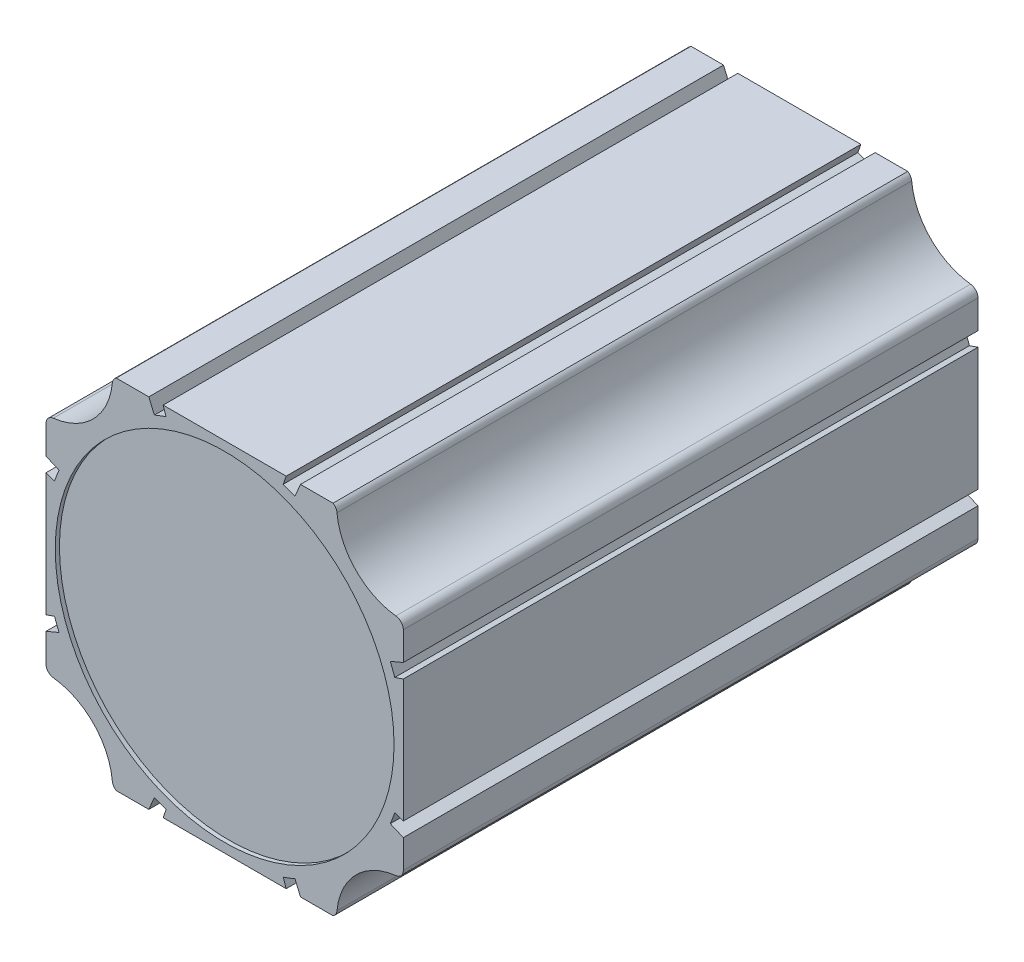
ISO-10303-21;
HEADER;
FILE_DESCRIPTION(('STEP AP214'),'2;1');
FILE_NAME('part.step','',(''),(''),'','','');
FILE_SCHEMA(('AUTOMOTIVE_DESIGN { 1 0 10303 214 1 1 1 1 }'));
ENDSEC;
DATA;
#1=APPLICATION_CONTEXT('core data for automotive mechanical design processes');
#2=APPLICATION_PROTOCOL_DEFINITION('international standard','automotive_design',2000,#1);
#3=PRODUCT_CONTEXT('',#1,'mechanical');
#4=PRODUCT('Part','Part','',(#3));
#5=PRODUCT_RELATED_PRODUCT_CATEGORY('part','',(#4));
#6=PRODUCT_DEFINITION_FORMATION('','',#4);
#7=PRODUCT_DEFINITION_CONTEXT('part definition',#1,'design');
#8=PRODUCT_DEFINITION('design','',#6,#7);
#9=PRODUCT_DEFINITION_SHAPE('','',#8);
#10=(LENGTH_UNIT() NAMED_UNIT(*) SI_UNIT(.MILLI.,.METRE.));
#11=(NAMED_UNIT(*) PLANE_ANGLE_UNIT() SI_UNIT($,.RADIAN.));
#12=(NAMED_UNIT(*) SI_UNIT($,.STERADIAN.) SOLID_ANGLE_UNIT());
#13=UNCERTAINTY_MEASURE_WITH_UNIT(LENGTH_MEASURE(1.E-05),#10,'distance_accuracy_value','');
#14=(GEOMETRIC_REPRESENTATION_CONTEXT(3) GLOBAL_UNCERTAINTY_ASSIGNED_CONTEXT((#13)) GLOBAL_UNIT_ASSIGNED_CONTEXT((#10,
#11,#12)) REPRESENTATION_CONTEXT('',''));
#15=CARTESIAN_POINT('',(0.,0.,0.));
#16=DIRECTION('',(0.,0.,1.));
#17=DIRECTION('',(1.,0.,0.));
#18=AXIS2_PLACEMENT_3D('',#15,#16,#17);
#19=CARTESIAN_POINT('',(-42.9,-42.9,138.));
#20=DIRECTION('',(0.,1.,0.));
#21=DIRECTION('',(0.,0.,1.));
#22=AXIS2_PLACEMENT_3D('',#19,#20,#21);
#23=PLANE('',#22);
#24=DIRECTION('',(1.,0.,0.));
#25=VECTOR('',#24,1.);
#26=CARTESIAN_POINT('',(-42.9,-42.9,138.));
#27=LINE('',#26,#25);
#28=CARTESIAN_POINT('',(18.2099696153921,-42.9,138.));
#29=VERTEX_POINT('',#28);
#30=CARTESIAN_POINT('',(26.0262545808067,-42.9,138.));
#31=VERTEX_POINT('',#30);
#32=EDGE_CURVE('E644',#29,#31,#27,.T.);
#33=ORIENTED_EDGE('',*,*,#32,.F.);
#34=DIRECTION('',(0.,0.,-1.));
#35=VECTOR('',#34,1.);
#36=CARTESIAN_POINT('',(18.2099696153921,-42.9,138.));
#37=LINE('',#36,#35);
#38=CARTESIAN_POINT('',(18.2099696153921,-42.9,0.));
#39=VERTEX_POINT('',#38);
#40=EDGE_CURVE('E355',#29,#39,#37,.T.);
#41=ORIENTED_EDGE('',*,*,#40,.T.);
#42=DIRECTION('',(1.,0.,0.));
#43=VECTOR('',#42,1.);
#44=CARTESIAN_POINT('',(-42.9,-42.9,0.));
#45=LINE('',#44,#43);
#46=CARTESIAN_POINT('',(26.0262545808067,-42.9,0.));
#47=VERTEX_POINT('',#46);
#48=EDGE_CURVE('E664',#39,#47,#45,.T.);
#49=ORIENTED_EDGE('',*,*,#48,.T.);
#50=DIRECTION('',(0.,0.,-1.));
#51=VECTOR('',#50,1.);
#52=CARTESIAN_POINT('',(26.0262545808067,-42.9,138.));
#53=LINE('',#52,#51);
#54=EDGE_CURVE('E617',#31,#47,#53,.T.);
#55=ORIENTED_EDGE('',*,*,#54,.F.);
#56=EDGE_LOOP('',(#33,#41,#49,#55));
#57=FACE_BOUND('',#56,.T.);
#58=ADVANCED_FACE('F17',(#57),#23,.F.);
#59=CARTESIAN_POINT('',(-42.9,42.9,138.));
#60=DIRECTION('',(1.,0.,0.));
#61=DIRECTION('',(0.,1.,0.));
#62=AXIS2_PLACEMENT_3D('',#59,#60,#61);
#63=PLANE('',#62);
#64=DIRECTION('',(0.,-1.,0.));
#65=VECTOR('',#64,1.);
#66=CARTESIAN_POINT('',(-42.9,42.9,138.));
#67=LINE('',#66,#65);
#68=CARTESIAN_POINT('',(-42.9,-18.2099696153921,138.));
#69=VERTEX_POINT('',#68);
#70=CARTESIAN_POINT('',(-42.9,-25.0114561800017,138.));
#71=VERTEX_POINT('',#70);
#72=EDGE_CURVE('E646',#69,#71,#67,.T.);
#73=ORIENTED_EDGE('',*,*,#72,.F.);
#74=DIRECTION('',(0.,0.,-1.));
#75=VECTOR('',#74,1.);
#76=CARTESIAN_POINT('',(-42.9,-18.2099696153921,138.));
#77=LINE('',#76,#75);
#78=CARTESIAN_POINT('',(-42.9,-18.2099696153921,0.));
#79=VERTEX_POINT('',#78);
#80=EDGE_CURVE('E376',#69,#79,#77,.T.);
#81=ORIENTED_EDGE('',*,*,#80,.T.);
#82=DIRECTION('',(0.,-1.,0.));
#83=VECTOR('',#82,1.);
#84=CARTESIAN_POINT('',(-42.9,42.9,0.));
#85=LINE('',#84,#83);
#86=CARTESIAN_POINT('',(-42.9,-25.0114561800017,0.));
#87=VERTEX_POINT('',#86);
#88=EDGE_CURVE('E599',#79,#87,#85,.T.);
#89=ORIENTED_EDGE('',*,*,#88,.T.);
#90=DIRECTION('',(0.,0.,-1.));
#91=VECTOR('',#90,1.);
#92=CARTESIAN_POINT('',(-42.9,-25.0114561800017,138.));
#93=LINE('',#92,#91);
#94=EDGE_CURVE('E606',#71,#87,#93,.T.);
#95=ORIENTED_EDGE('',*,*,#94,.F.);
#96=EDGE_LOOP('',(#73,#81,#89,#95));
#97=FACE_BOUND('',#96,.T.);
#98=ADVANCED_FACE('F707',(#97),#63,.F.);
#99=CARTESIAN_POINT('',(42.9,42.9,138.));
#100=DIRECTION('',(-1.,0.,0.));
#101=DIRECTION('',(0.,-1.,0.));
#102=AXIS2_PLACEMENT_3D('',#99,#100,#101);
#103=PLANE('',#102);
#104=DIRECTION('',(0.,1.,0.));
#105=VECTOR('',#104,1.);
#106=CARTESIAN_POINT('',(42.9,42.9,138.));
#107=LINE('',#106,#105);
#108=CARTESIAN_POINT('',(42.9,-14.7716546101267,138.));
#109=VERTEX_POINT('',#108);
#110=CARTESIAN_POINT('',(42.9,14.7716546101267,138.));
#111=VERTEX_POINT('',#110);
#112=EDGE_CURVE('E655',#109,#111,#107,.T.);
#113=ORIENTED_EDGE('',*,*,#112,.F.);
#114=DIRECTION('',(0.,0.,-1.));
#115=VECTOR('',#114,1.);
#116=CARTESIAN_POINT('',(42.9,-14.7716546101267,138.));
#117=LINE('',#116,#115);
#118=CARTESIAN_POINT('',(42.9,-14.7716546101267,0.));
#119=VERTEX_POINT('',#118);
#120=EDGE_CURVE('E400',#109,#119,#117,.T.);
#121=ORIENTED_EDGE('',*,*,#120,.T.);
#122=DIRECTION('',(0.,1.,0.));
#123=VECTOR('',#122,1.);
#124=CARTESIAN_POINT('',(42.9,42.9,0.));
#125=LINE('',#124,#123);
#126=CARTESIAN_POINT('',(42.9,14.7716546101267,0.));
#127=VERTEX_POINT('',#126);
#128=EDGE_CURVE('E675',#119,#127,#125,.T.);
#129=ORIENTED_EDGE('',*,*,#128,.T.);
#130=DIRECTION('',(0.,0.,1.));
#131=VECTOR('',#130,1.);
#132=CARTESIAN_POINT('',(42.9,14.7716546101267,138.));
#133=LINE('',#132,#131);
#134=EDGE_CURVE('E497',#127,#111,#133,.T.);
#135=ORIENTED_EDGE('',*,*,#134,.T.);
#136=EDGE_LOOP('',(#113,#121,#129,#135));
#137=FACE_BOUND('',#136,.T.);
#138=ADVANCED_FACE('F744',(#137),#103,.F.);
#139=CARTESIAN_POINT('',(-14.7716546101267,-42.9,0.));
#140=VERTEX_POINT('',#139);
#141=CARTESIAN_POINT('',(14.7716546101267,-42.9,0.));
#142=VERTEX_POINT('',#141);
#143=EDGE_CURVE('E670',#140,#142,#45,.T.);
#144=ORIENTED_EDGE('',*,*,#143,.T.);
#145=DIRECTION('',(0.,0.,1.));
#146=VECTOR('',#145,1.);
#147=CARTESIAN_POINT('',(14.7716546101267,-42.9,138.));
#148=LINE('',#147,#146);
#149=CARTESIAN_POINT('',(14.7716546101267,-42.9,138.));
#150=VERTEX_POINT('',#149);
#151=EDGE_CURVE('E32',#142,#150,#148,.T.);
#152=ORIENTED_EDGE('',*,*,#151,.T.);
#153=CARTESIAN_POINT('',(-14.7716546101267,-42.9,138.));
#154=VERTEX_POINT('',#153);
#155=EDGE_CURVE('E344',#154,#150,#27,.T.);
#156=ORIENTED_EDGE('',*,*,#155,.F.);
#157=DIRECTION('',(0.,0.,-1.));
#158=VECTOR('',#157,1.);
#159=CARTESIAN_POINT('',(-14.7716546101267,-42.9,138.));
#160=LINE('',#159,#158);
#161=EDGE_CURVE('E424',#154,#140,#160,.T.);
#162=ORIENTED_EDGE('',*,*,#161,.T.);
#163=EDGE_LOOP('',(#144,#152,#156,#162));
#164=FACE_BOUND('',#163,.T.);
#165=ADVANCED_FACE('F738',(#164),#23,.F.);
#166=CARTESIAN_POINT('',(-42.9,42.9,138.));
#167=DIRECTION('',(0.,-1.,0.));
#168=DIRECTION('',(0.,0.,-1.));
#169=AXIS2_PLACEMENT_3D('',#166,#167,#168);
#170=PLANE('',#169);
#171=DIRECTION('',(-1.,0.,0.));
#172=VECTOR('',#171,1.);
#173=CARTESIAN_POINT('',(-42.9,42.9,138.));
#174=LINE('',#173,#172);
#175=CARTESIAN_POINT('',(-18.2099696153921,42.9,138.));
#176=VERTEX_POINT('',#175);
#177=CARTESIAN_POINT('',(-26.0262545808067,42.9,138.));
#178=VERTEX_POINT('',#177);
#179=EDGE_CURVE('E654',#176,#178,#174,.T.);
#180=ORIENTED_EDGE('',*,*,#179,.F.);
#181=DIRECTION('',(0.,0.,-1.));
#182=VECTOR('',#181,1.);
#183=CARTESIAN_POINT('',(-18.2099696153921,42.9,138.));
#184=LINE('',#183,#182);
#185=CARTESIAN_POINT('',(-18.2099696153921,42.9,0.));
#186=VERTEX_POINT('',#185);
#187=EDGE_CURVE('E448',#176,#186,#184,.T.);
#188=ORIENTED_EDGE('',*,*,#187,.T.);
#189=DIRECTION('',(-1.,0.,0.));
#190=VECTOR('',#189,1.);
#191=CARTESIAN_POINT('',(-42.9,42.9,0.));
#192=LINE('',#191,#190);
#193=CARTESIAN_POINT('',(-26.0262545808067,42.9,0.));
#194=VERTEX_POINT('',#193);
#195=EDGE_CURVE('E674',#186,#194,#192,.T.);
#196=ORIENTED_EDGE('',*,*,#195,.T.);
#197=DIRECTION('',(0.,0.,-1.));
#198=VECTOR('',#197,1.);
#199=CARTESIAN_POINT('',(-26.0262545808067,42.9,138.));
#200=LINE('',#199,#198);
#201=EDGE_CURVE('E562',#178,#194,#200,.T.);
#202=ORIENTED_EDGE('',*,*,#201,.F.);
#203=EDGE_LOOP('',(#180,#188,#196,#202));
#204=FACE_BOUND('',#203,.T.);
#205=ADVANCED_FACE('F748',(#204),#170,.F.);
#206=CARTESIAN_POINT('',(-42.9,14.7716546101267,0.));
#207=VERTEX_POINT('',#206);
#208=CARTESIAN_POINT('',(-42.9,-14.7716546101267,0.));
#209=VERTEX_POINT('',#208);
#210=EDGE_CURVE('E665',#207,#209,#85,.T.);
#211=ORIENTED_EDGE('',*,*,#210,.T.);
#212=DIRECTION('',(0.,0.,1.));
#213=VECTOR('',#212,1.);
#214=CARTESIAN_POINT('',(-42.9,-14.7716546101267,138.));
#215=LINE('',#214,#213);
#216=CARTESIAN_POINT('',(-42.9,-14.7716546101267,138.));
#217=VERTEX_POINT('',#216);
#218=EDGE_CURVE('E40',#209,#217,#215,.T.);
#219=ORIENTED_EDGE('',*,*,#218,.T.);
#220=CARTESIAN_POINT('',(-42.9,14.7716546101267,138.));
#221=VERTEX_POINT('',#220);
#222=EDGE_CURVE('E645',#221,#217,#67,.T.);
#223=ORIENTED_EDGE('',*,*,#222,.F.);
#224=DIRECTION('',(0.,0.,-1.));
#225=VECTOR('',#224,1.);
#226=CARTESIAN_POINT('',(-42.9,14.7716546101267,138.));
#227=LINE('',#226,#225);
#228=EDGE_CURVE('E472',#221,#207,#227,.T.);
#229=ORIENTED_EDGE('',*,*,#228,.T.);
#230=EDGE_LOOP('',(#211,#219,#223,#229));
#231=FACE_BOUND('',#230,.T.);
#232=ADVANCED_FACE('F718',(#231),#63,.F.);
#233=CARTESIAN_POINT('',(42.9,-25.0114561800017,0.));
#234=VERTEX_POINT('',#233);
#235=CARTESIAN_POINT('',(42.9,-18.2099696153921,0.));
#236=VERTEX_POINT('',#235);
#237=EDGE_CURVE('E671',#234,#236,#125,.T.);
#238=ORIENTED_EDGE('',*,*,#237,.T.);
#239=DIRECTION('',(0.,0.,1.));
#240=VECTOR('',#239,1.);
#241=CARTESIAN_POINT('',(42.9,-18.2099696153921,138.));
#242=LINE('',#241,#240);
#243=CARTESIAN_POINT('',(42.9,-18.2099696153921,138.));
#244=VERTEX_POINT('',#243);
#245=EDGE_CURVE('E396',#236,#244,#242,.T.);
#246=ORIENTED_EDGE('',*,*,#245,.T.);
#247=CARTESIAN_POINT('',(42.9,-25.0114561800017,138.));
#248=VERTEX_POINT('',#247);
#249=EDGE_CURVE('E651',#248,#244,#107,.T.);
#250=ORIENTED_EDGE('',*,*,#249,.F.);
#251=DIRECTION('',(0.,0.,-1.));
#252=VECTOR('',#251,1.);
#253=CARTESIAN_POINT('',(42.9,-25.0114561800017,138.));
#254=LINE('',#253,#252);
#255=EDGE_CURVE('E625',#248,#234,#254,.T.);
#256=ORIENTED_EDGE('',*,*,#255,.T.);
#257=EDGE_LOOP('',(#238,#246,#250,#256));
#258=FACE_BOUND('',#257,.T.);
#259=ADVANCED_FACE('F760',(#258),#103,.F.);
#260=CARTESIAN_POINT('',(14.7716546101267,42.9,0.));
#261=VERTEX_POINT('',#260);
#262=CARTESIAN_POINT('',(-14.7716546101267,42.9,0.));
#263=VERTEX_POINT('',#262);
#264=EDGE_CURVE('E679',#261,#263,#192,.T.);
#265=ORIENTED_EDGE('',*,*,#264,.T.);
#266=DIRECTION('',(0.,0.,1.));
#267=VECTOR('',#266,1.);
#268=CARTESIAN_POINT('',(-14.7716546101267,42.9,138.));
#269=LINE('',#268,#267);
#270=CARTESIAN_POINT('',(-14.7716546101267,42.9,138.));
#271=VERTEX_POINT('',#270);
#272=EDGE_CURVE('E444',#263,#271,#269,.T.);
#273=ORIENTED_EDGE('',*,*,#272,.T.);
#274=CARTESIAN_POINT('',(14.7716546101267,42.9,138.));
#275=VERTEX_POINT('',#274);
#276=EDGE_CURVE('E660',#275,#271,#174,.T.);
#277=ORIENTED_EDGE('',*,*,#276,.F.);
#278=DIRECTION('',(0.,0.,-1.));
#279=VECTOR('',#278,1.);
#280=CARTESIAN_POINT('',(14.7716546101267,42.9,138.));
#281=LINE('',#280,#279);
#282=EDGE_CURVE('E521',#275,#261,#281,.T.);
#283=ORIENTED_EDGE('',*,*,#282,.T.);
#284=EDGE_LOOP('',(#265,#273,#277,#283));
#285=FACE_BOUND('',#284,.T.);
#286=ADVANCED_FACE('F761',(#285),#170,.F.);
#287=CARTESIAN_POINT('',(-42.9,25.0114561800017,0.));
#288=VERTEX_POINT('',#287);
#289=CARTESIAN_POINT('',(-42.9,18.2099696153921,0.));
#290=VERTEX_POINT('',#289);
#291=EDGE_CURVE('E661',#288,#290,#85,.T.);
#292=ORIENTED_EDGE('',*,*,#291,.T.);
#293=DIRECTION('',(0.,0.,1.));
#294=VECTOR('',#293,1.);
#295=CARTESIAN_POINT('',(-42.9,18.2099696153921,138.));
#296=LINE('',#295,#294);
#297=CARTESIAN_POINT('',(-42.9,18.2099696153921,138.));
#298=VERTEX_POINT('',#297);
#299=EDGE_CURVE('E468',#290,#298,#296,.T.);
#300=ORIENTED_EDGE('',*,*,#299,.T.);
#301=CARTESIAN_POINT('',(-42.9,25.0114561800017,138.));
#302=VERTEX_POINT('',#301);
#303=EDGE_CURVE('E641',#302,#298,#67,.T.);
#304=ORIENTED_EDGE('',*,*,#303,.F.);
#305=DIRECTION('',(0.,0.,-1.));
#306=VECTOR('',#305,1.);
#307=CARTESIAN_POINT('',(-42.9,25.0114561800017,138.));
#308=LINE('',#307,#306);
#309=EDGE_CURVE('E603',#302,#288,#308,.T.);
#310=ORIENTED_EDGE('',*,*,#309,.T.);
#311=EDGE_LOOP('',(#292,#300,#304,#310));
#312=FACE_BOUND('',#311,.T.);
#313=ADVANCED_FACE('F19',(#312),#63,.F.);
#314=CARTESIAN_POINT('',(-26.0262545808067,-42.9,0.));
#315=VERTEX_POINT('',#314);
#316=CARTESIAN_POINT('',(-18.2099696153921,-42.9,0.));
#317=VERTEX_POINT('',#316);
#318=EDGE_CURVE('E666',#315,#317,#45,.T.);
#319=ORIENTED_EDGE('',*,*,#318,.T.);
#320=DIRECTION('',(0.,0.,1.));
#321=VECTOR('',#320,1.);
#322=CARTESIAN_POINT('',(-18.2099696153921,-42.9,138.));
#323=LINE('',#322,#321);
#324=CARTESIAN_POINT('',(-18.2099696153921,-42.9,138.));
#325=VERTEX_POINT('',#324);
#326=EDGE_CURVE('E420',#317,#325,#323,.T.);
#327=ORIENTED_EDGE('',*,*,#326,.T.);
#328=CARTESIAN_POINT('',(-26.0262545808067,-42.9,138.));
#329=VERTEX_POINT('',#328);
#330=EDGE_CURVE('E647',#329,#325,#27,.T.);
#331=ORIENTED_EDGE('',*,*,#330,.F.);
#332=DIRECTION('',(0.,0.,-1.));
#333=VECTOR('',#332,1.);
#334=CARTESIAN_POINT('',(-26.0262545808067,-42.9,138.));
#335=LINE('',#334,#333);
#336=EDGE_CURVE('E614',#329,#315,#335,.T.);
#337=ORIENTED_EDGE('',*,*,#336,.T.);
#338=EDGE_LOOP('',(#319,#327,#331,#337));
#339=FACE_BOUND('',#338,.T.);
#340=ADVANCED_FACE('F739',(#339),#23,.F.);
#341=CARTESIAN_POINT('',(42.9,18.2099696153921,138.));
#342=VERTEX_POINT('',#341);
#343=CARTESIAN_POINT('',(42.9,25.0114561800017,138.));
#344=VERTEX_POINT('',#343);
#345=EDGE_CURVE('E650',#342,#344,#107,.T.);
#346=ORIENTED_EDGE('',*,*,#345,.F.);
#347=DIRECTION('',(0.,0.,-1.));
#348=VECTOR('',#347,1.);
#349=CARTESIAN_POINT('',(42.9,18.2099696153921,138.));
#350=LINE('',#349,#348);
#351=CARTESIAN_POINT('',(42.9,18.2099696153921,0.));
#352=VERTEX_POINT('',#351);
#353=EDGE_CURVE('E492',#342,#352,#350,.T.);
#354=ORIENTED_EDGE('',*,*,#353,.T.);
#355=CARTESIAN_POINT('',(42.9,25.0114561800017,0.));
#356=VERTEX_POINT('',#355);
#357=EDGE_CURVE('E669',#352,#356,#125,.T.);
#358=ORIENTED_EDGE('',*,*,#357,.T.);
#359=DIRECTION('',(0.,0.,-1.));
#360=VECTOR('',#359,1.);
#361=CARTESIAN_POINT('',(42.9,25.0114561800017,138.));
#362=LINE('',#361,#360);
#363=EDGE_CURVE('E628',#344,#356,#362,.T.);
#364=ORIENTED_EDGE('',*,*,#363,.F.);
#365=EDGE_LOOP('',(#346,#354,#358,#364));
#366=FACE_BOUND('',#365,.T.);
#367=ADVANCED_FACE('F751',(#366),#103,.F.);
#368=CARTESIAN_POINT('',(26.0262545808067,42.9,0.));
#369=VERTEX_POINT('',#368);
#370=CARTESIAN_POINT('',(18.2099696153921,42.9,0.));
#371=VERTEX_POINT('',#370);
#372=EDGE_CURVE('E676',#369,#371,#192,.T.);
#373=ORIENTED_EDGE('',*,*,#372,.T.);
#374=DIRECTION('',(0.,0.,1.));
#375=VECTOR('',#374,1.);
#376=CARTESIAN_POINT('',(18.2099696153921,42.9,138.));
#377=LINE('',#376,#375);
#378=CARTESIAN_POINT('',(18.2099696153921,42.9,138.));
#379=VERTEX_POINT('',#378);
#380=EDGE_CURVE('E517',#371,#379,#377,.T.);
#381=ORIENTED_EDGE('',*,*,#380,.T.);
#382=CARTESIAN_POINT('',(26.0262545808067,42.9,138.));
#383=VERTEX_POINT('',#382);
#384=EDGE_CURVE('E656',#383,#379,#174,.T.);
#385=ORIENTED_EDGE('',*,*,#384,.F.);
#386=DIRECTION('',(0.,0.,-1.));
#387=VECTOR('',#386,1.);
#388=CARTESIAN_POINT('',(26.0262545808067,42.9,138.));
#389=LINE('',#388,#387);
#390=EDGE_CURVE('E636',#383,#369,#389,.T.);
#391=ORIENTED_EDGE('',*,*,#390,.T.);
#392=EDGE_LOOP('',(#373,#381,#385,#391));
#393=FACE_BOUND('',#392,.T.);
#394=ADVANCED_FACE('F758',(#393),#170,.F.);
#395=CARTESIAN_POINT('',(-42.9,-42.9,138.));
#396=DIRECTION('',(0.,0.,1.));
#397=DIRECTION('',(1.,0.,0.));
#398=AXIS2_PLACEMENT_3D('',#395,#396,#397);
#399=PLANE('',#398);
#400=CARTESIAN_POINT('',(0.,0.,138.));
#401=DIRECTION('',(0.,0.,1.));
#402=DIRECTION('',(1.,0.,0.));
#403=AXIS2_PLACEMENT_3D('',#400,#401,#402);
#404=CIRCLE('',#403,40.675);
#405=CARTESIAN_POINT('',(40.675,0.,138.));
#406=VERTEX_POINT('',#405);
#407=EDGE_CURVE('E1163',#406,#406,#404,.T.);
#408=ORIENTED_EDGE('',*,*,#407,.F.);
#409=EDGE_LOOP('',(#408));
#410=FACE_BOUND('',#409,.T.);
#411=DIRECTION('',(-0.390731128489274,0.92050485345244,0.));
#412=VECTOR('',#411,1.);
#413=CARTESIAN_POINT('',(16.8795847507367,-39.7658096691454,138.));
#414=LINE('',#413,#412);
#415=CARTESIAN_POINT('',(16.8795847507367,-39.7658096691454,138.));
#416=VERTEX_POINT('',#415);
#417=EDGE_CURVE('E345',#29,#416,#414,.T.);
#418=ORIENTED_EDGE('',*,*,#417,.F.);
#419=ORIENTED_EDGE('',*,*,#32,.T.);
#420=CARTESIAN_POINT('',(24.9809408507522,-41.194913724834,138.));
#421=DIRECTION('',(0.,0.,-1.));
#422=DIRECTION('',(1.,0.,0.));
#423=AXIS2_PLACEMENT_3D('',#420,#421,#422);
#424=CIRCLE('',#423,1.99999999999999);
#425=CARTESIAN_POINT('',(26.9719474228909,-41.384367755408,138.));
#426=VERTEX_POINT('',#425);
#427=EDGE_CURVE('E544',#426,#31,#424,.T.);
#428=ORIENTED_EDGE('',*,*,#427,.F.);
#429=CARTESIAN_POINT('',(42.9,-42.9,138.));
#430=DIRECTION('',(0.,0.,1.));
#431=DIRECTION('',(-1.,0.,0.));
#432=AXIS2_PLACEMENT_3D('',#429,#430,#431);
#433=CIRCLE('',#432,16.);
#434=CARTESIAN_POINT('',(41.1222222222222,-26.9990721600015,138.));
#435=VERTEX_POINT('',#434);
#436=EDGE_CURVE('E541',#435,#426,#433,.T.);
#437=ORIENTED_EDGE('',*,*,#436,.F.);
#438=CARTESIAN_POINT('',(40.9,-25.0114561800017,138.));
#439=DIRECTION('',(0.,0.,-1.));
#440=DIRECTION('',(-1.,0.,0.));
#441=AXIS2_PLACEMENT_3D('',#438,#439,#440);
#442=CIRCLE('',#441,2.);
#443=EDGE_CURVE('E538',#248,#435,#442,.T.);
#444=ORIENTED_EDGE('',*,*,#443,.F.);
#445=ORIENTED_EDGE('',*,*,#249,.T.);
#446=DIRECTION('',(0.92050485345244,-0.390731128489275,0.));
#447=VECTOR('',#446,1.);
#448=CARTESIAN_POINT('',(39.7658096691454,-16.8795847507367,138.));
#449=LINE('',#448,#447);
#450=CARTESIAN_POINT('',(39.7658096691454,-16.8795847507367,138.));
#451=VERTEX_POINT('',#450);
#452=EDGE_CURVE('E382',#451,#244,#449,.T.);
#453=ORIENTED_EDGE('',*,*,#452,.F.);
#454=CARTESIAN_POINT('',(0.,0.,138.));
#455=DIRECTION('',(0.,0.,-1.));
#456=DIRECTION('',(-1.,0.,0.));
#457=AXIS2_PLACEMENT_3D('',#454,#455,#456);
#458=CIRCLE('',#457,43.2);
#459=CARTESIAN_POINT('',(40.8464024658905,-14.0645442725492,138.));
#460=VERTEX_POINT('',#459);
#461=EDGE_CURVE('E379',#460,#451,#458,.T.);
#462=ORIENTED_EDGE('',*,*,#461,.F.);
#463=DIRECTION('',(-0.945518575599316,0.325568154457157,0.));
#464=VECTOR('',#463,1.);
#465=CARTESIAN_POINT('',(40.8464024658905,-14.0645442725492,138.));
#466=LINE('',#465,#464);
#467=EDGE_CURVE('E384',#109,#460,#466,.T.);
#468=ORIENTED_EDGE('',*,*,#467,.F.);
#469=ORIENTED_EDGE('',*,*,#112,.T.);
#470=DIRECTION('',(0.945518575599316,0.325568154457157,0.));
#471=VECTOR('',#470,1.);
#472=CARTESIAN_POINT('',(40.8464024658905,14.0645442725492,138.));
#473=LINE('',#472,#471);
#474=CARTESIAN_POINT('',(40.8464024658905,14.0645442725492,138.));
#475=VERTEX_POINT('',#474);
#476=EDGE_CURVE('E480',#475,#111,#473,.T.);
#477=ORIENTED_EDGE('',*,*,#476,.F.);
#478=CARTESIAN_POINT('',(0.,0.,138.));
#479=DIRECTION('',(0.,0.,-1.));
#480=DIRECTION('',(1.,0.,0.));
#481=AXIS2_PLACEMENT_3D('',#478,#479,#480);
#482=CIRCLE('',#481,43.2);
#483=CARTESIAN_POINT('',(39.7658096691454,16.8795847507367,138.));
#484=VERTEX_POINT('',#483);
#485=EDGE_CURVE('E477',#484,#475,#482,.T.);
#486=ORIENTED_EDGE('',*,*,#485,.F.);
#487=DIRECTION('',(-0.92050485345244,-0.390731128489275,0.));
#488=VECTOR('',#487,1.);
#489=CARTESIAN_POINT('',(39.7658096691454,16.8795847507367,138.));
#490=LINE('',#489,#488);
#491=EDGE_CURVE('E475',#342,#484,#490,.T.);
#492=ORIENTED_EDGE('',*,*,#491,.F.);
#493=ORIENTED_EDGE('',*,*,#345,.T.);
#494=CARTESIAN_POINT('',(40.9,25.0114561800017,138.));
#495=DIRECTION('',(0.,0.,-1.));
#496=DIRECTION('',(1.,0.,0.));
#497=AXIS2_PLACEMENT_3D('',#494,#495,#496);
#498=CIRCLE('',#497,2.);
#499=CARTESIAN_POINT('',(41.1222222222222,26.9990721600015,138.));
#500=VERTEX_POINT('',#499);
#501=EDGE_CURVE('E535',#500,#344,#498,.T.);
#502=ORIENTED_EDGE('',*,*,#501,.F.);
#503=CARTESIAN_POINT('',(42.9,42.9,138.));
#504=DIRECTION('',(0.,0.,1.));
#505=DIRECTION('',(1.,0.,0.));
#506=AXIS2_PLACEMENT_3D('',#503,#504,#505);
#507=CIRCLE('',#506,16.);
#508=CARTESIAN_POINT('',(26.9719474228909,41.384367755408,138.));
#509=VERTEX_POINT('',#508);
#510=EDGE_CURVE('E532',#509,#500,#507,.T.);
#511=ORIENTED_EDGE('',*,*,#510,.F.);
#512=CARTESIAN_POINT('',(24.9809408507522,41.194913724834,138.));
#513=DIRECTION('',(0.,0.,-1.));
#514=DIRECTION('',(-1.,0.,0.));
#515=AXIS2_PLACEMENT_3D('',#512,#513,#514);
#516=CIRCLE('',#515,1.99999999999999);
#517=EDGE_CURVE('E528',#383,#509,#516,.T.);
#518=ORIENTED_EDGE('',*,*,#517,.F.);
#519=ORIENTED_EDGE('',*,*,#384,.T.);
#520=DIRECTION('',(0.390731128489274,0.92050485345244,0.));
#521=VECTOR('',#520,1.);
#522=CARTESIAN_POINT('',(16.8795847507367,39.7658096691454,138.));
#523=LINE('',#522,#521);
#524=CARTESIAN_POINT('',(16.8795847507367,39.7658096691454,138.));
#525=VERTEX_POINT('',#524);
#526=EDGE_CURVE('E503',#525,#379,#523,.T.);
#527=ORIENTED_EDGE('',*,*,#526,.F.);
#528=CARTESIAN_POINT('',(0.,0.,138.));
#529=DIRECTION('',(0.,0.,-1.));
#530=DIRECTION('',(-1.,0.,0.));
#531=AXIS2_PLACEMENT_3D('',#528,#529,#530);
#532=CIRCLE('',#531,43.2);
#533=CARTESIAN_POINT('',(14.0645442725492,40.8464024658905,138.));
#534=VERTEX_POINT('',#533);
#535=EDGE_CURVE('E500',#534,#525,#532,.T.);
#536=ORIENTED_EDGE('',*,*,#535,.F.);
#537=DIRECTION('',(-0.325568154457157,-0.945518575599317,0.));
#538=VECTOR('',#537,1.);
#539=CARTESIAN_POINT('',(14.0645442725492,40.8464024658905,138.));
#540=LINE('',#539,#538);
#541=EDGE_CURVE('E505',#275,#534,#540,.T.);
#542=ORIENTED_EDGE('',*,*,#541,.F.);
#543=ORIENTED_EDGE('',*,*,#276,.T.);
#544=DIRECTION('',(-0.325568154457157,0.945518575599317,0.));
#545=VECTOR('',#544,1.);
#546=CARTESIAN_POINT('',(-14.0645442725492,40.8464024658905,138.));
#547=LINE('',#546,#545);
#548=CARTESIAN_POINT('',(-14.0645442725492,40.8464024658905,138.));
#549=VERTEX_POINT('',#548);
#550=EDGE_CURVE('E430',#549,#271,#547,.T.);
#551=ORIENTED_EDGE('',*,*,#550,.F.);
#552=CARTESIAN_POINT('',(0.,0.,138.));
#553=DIRECTION('',(0.,0.,-1.));
#554=DIRECTION('',(1.,0.,0.));
#555=AXIS2_PLACEMENT_3D('',#552,#553,#554);
#556=CIRCLE('',#555,43.2);
#557=CARTESIAN_POINT('',(-16.8795847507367,39.7658096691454,138.));
#558=VERTEX_POINT('',#557);
#559=EDGE_CURVE('E427',#558,#549,#556,.T.);
#560=ORIENTED_EDGE('',*,*,#559,.F.);
#561=DIRECTION('',(0.390731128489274,-0.92050485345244,0.));
#562=VECTOR('',#561,1.);
#563=CARTESIAN_POINT('',(-16.8795847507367,39.7658096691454,138.));
#564=LINE('',#563,#562);
#565=EDGE_CURVE('E432',#176,#558,#564,.T.);
#566=ORIENTED_EDGE('',*,*,#565,.F.);
#567=ORIENTED_EDGE('',*,*,#179,.T.);
#568=CARTESIAN_POINT('',(-24.9809408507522,41.194913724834,138.));
#569=DIRECTION('',(0.,0.,-1.));
#570=DIRECTION('',(1.,0.,0.));
#571=AXIS2_PLACEMENT_3D('',#568,#569,#570);
#572=CIRCLE('',#571,1.99999999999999);
#573=CARTESIAN_POINT('',(-26.9719474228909,41.384367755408,138.));
#574=VERTEX_POINT('',#573);
#575=EDGE_CURVE('E525',#574,#178,#572,.T.);
#576=ORIENTED_EDGE('',*,*,#575,.F.);
#577=CARTESIAN_POINT('',(-42.9,42.9,138.));
#578=DIRECTION('',(0.,0.,1.));
#579=DIRECTION('',(-1.,0.,0.));
#580=AXIS2_PLACEMENT_3D('',#577,#578,#579);
#581=CIRCLE('',#580,16.);
#582=CARTESIAN_POINT('',(-41.1222222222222,26.9990721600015,138.));
#583=VERTEX_POINT('',#582);
#584=EDGE_CURVE('E559',#583,#574,#581,.T.);
#585=ORIENTED_EDGE('',*,*,#584,.F.);
#586=CARTESIAN_POINT('',(-40.9,25.0114561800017,138.));
#587=DIRECTION('',(0.,0.,-1.));
#588=DIRECTION('',(-1.,0.,0.));
#589=AXIS2_PLACEMENT_3D('',#586,#587,#588);
#590=CIRCLE('',#589,2.);
#591=EDGE_CURVE('E556',#302,#583,#590,.T.);
#592=ORIENTED_EDGE('',*,*,#591,.F.);
#593=ORIENTED_EDGE('',*,*,#303,.T.);
#594=DIRECTION('',(-0.92050485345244,0.390731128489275,0.));
#595=VECTOR('',#594,1.);
#596=CARTESIAN_POINT('',(-39.7658096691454,16.8795847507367,138.));
#597=LINE('',#596,#595);
#598=CARTESIAN_POINT('',(-39.7658096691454,16.8795847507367,138.));
#599=VERTEX_POINT('',#598);
#600=EDGE_CURVE('E454',#599,#298,#597,.T.);
#601=ORIENTED_EDGE('',*,*,#600,.F.);
#602=CARTESIAN_POINT('',(0.,0.,138.));
#603=DIRECTION('',(0.,0.,-1.));
#604=DIRECTION('',(-1.,0.,0.));
#605=AXIS2_PLACEMENT_3D('',#602,#603,#604);
#606=CIRCLE('',#605,43.2);
#607=CARTESIAN_POINT('',(-40.8464024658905,14.0645442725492,138.));
#608=VERTEX_POINT('',#607);
#609=EDGE_CURVE('E451',#608,#599,#606,.T.);
#610=ORIENTED_EDGE('',*,*,#609,.F.);
#611=DIRECTION('',(0.945518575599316,-0.325568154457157,0.));
#612=VECTOR('',#611,1.);
#613=CARTESIAN_POINT('',(-40.8464024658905,14.0645442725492,138.));
#614=LINE('',#613,#612);
#615=EDGE_CURVE('E456',#221,#608,#614,.T.);
#616=ORIENTED_EDGE('',*,*,#615,.F.);
#617=ORIENTED_EDGE('',*,*,#222,.T.);
#618=DIRECTION('',(-0.945518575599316,-0.325568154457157,0.));
#619=VECTOR('',#618,1.);
#620=CARTESIAN_POINT('',(-40.8464024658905,-14.0645442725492,138.));
#621=LINE('',#620,#619);
#622=CARTESIAN_POINT('',(-40.8464024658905,-14.0645442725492,138.));
#623=VERTEX_POINT('',#622);
#624=EDGE_CURVE('E361',#623,#217,#621,.T.);
#625=ORIENTED_EDGE('',*,*,#624,.F.);
#626=CARTESIAN_POINT('',(0.,0.,138.));
#627=DIRECTION('',(0.,0.,-1.));
#628=DIRECTION('',(1.,0.,0.));
#629=AXIS2_PLACEMENT_3D('',#626,#627,#628);
#630=CIRCLE('',#629,43.2);
#631=CARTESIAN_POINT('',(-39.7658096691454,-16.8795847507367,138.));
#632=VERTEX_POINT('',#631);
#633=EDGE_CURVE('E358',#632,#623,#630,.T.);
#634=ORIENTED_EDGE('',*,*,#633,.F.);
#635=DIRECTION('',(0.92050485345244,0.390731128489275,0.));
#636=VECTOR('',#635,1.);
#637=CARTESIAN_POINT('',(-39.7658096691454,-16.8795847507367,138.));
#638=LINE('',#637,#636);
#639=EDGE_CURVE('E363',#69,#632,#638,.T.);
#640=ORIENTED_EDGE('',*,*,#639,.F.);
#641=ORIENTED_EDGE('',*,*,#72,.T.);
#642=CARTESIAN_POINT('',(-40.9,-25.0114561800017,138.));
#643=DIRECTION('',(0.,0.,-1.));
#644=DIRECTION('',(1.,0.,0.));
#645=AXIS2_PLACEMENT_3D('',#642,#643,#644);
#646=CIRCLE('',#645,2.);
#647=CARTESIAN_POINT('',(-41.1222222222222,-26.9990721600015,138.));
#648=VERTEX_POINT('',#647);
#649=EDGE_CURVE('E553',#648,#71,#646,.T.);
#650=ORIENTED_EDGE('',*,*,#649,.F.);
#651=CARTESIAN_POINT('',(-42.9,-42.9,138.));
#652=DIRECTION('',(0.,0.,1.));
#653=DIRECTION('',(1.,0.,0.));
#654=AXIS2_PLACEMENT_3D('',#651,#652,#653);
#655=CIRCLE('',#654,16.);
#656=CARTESIAN_POINT('',(-26.9719474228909,-41.384367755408,138.));
#657=VERTEX_POINT('',#656);
#658=EDGE_CURVE('E550',#657,#648,#655,.T.);
#659=ORIENTED_EDGE('',*,*,#658,.F.);
#660=CARTESIAN_POINT('',(-24.9809408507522,-41.194913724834,138.));
#661=DIRECTION('',(0.,0.,-1.));
#662=DIRECTION('',(-1.,0.,0.));
#663=AXIS2_PLACEMENT_3D('',#660,#661,#662);
#664=CIRCLE('',#663,1.99999999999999);
#665=EDGE_CURVE('E547',#329,#657,#664,.T.);
#666=ORIENTED_EDGE('',*,*,#665,.F.);
#667=ORIENTED_EDGE('',*,*,#330,.T.);
#668=DIRECTION('',(-0.390731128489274,-0.92050485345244,0.));
#669=VECTOR('',#668,1.);
#670=CARTESIAN_POINT('',(-16.8795847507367,-39.7658096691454,138.));
#671=LINE('',#670,#669);
#672=CARTESIAN_POINT('',(-16.8795847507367,-39.7658096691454,138.));
#673=VERTEX_POINT('',#672);
#674=EDGE_CURVE('E406',#673,#325,#671,.T.);
#675=ORIENTED_EDGE('',*,*,#674,.F.);
#676=CARTESIAN_POINT('',(0.,0.,138.));
#677=DIRECTION('',(0.,0.,-1.));
#678=DIRECTION('',(-1.,0.,0.));
#679=AXIS2_PLACEMENT_3D('',#676,#677,#678);
#680=CIRCLE('',#679,43.2);
#681=CARTESIAN_POINT('',(-14.0645442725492,-40.8464024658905,138.));
#682=VERTEX_POINT('',#681);
#683=EDGE_CURVE('E403',#682,#673,#680,.T.);
#684=ORIENTED_EDGE('',*,*,#683,.F.);
#685=DIRECTION('',(0.325568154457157,0.945518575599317,0.));
#686=VECTOR('',#685,1.);
#687=CARTESIAN_POINT('',(-14.0645442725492,-40.8464024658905,138.));
#688=LINE('',#687,#686);
#689=EDGE_CURVE('E408',#154,#682,#688,.T.);
#690=ORIENTED_EDGE('',*,*,#689,.F.);
#691=ORIENTED_EDGE('',*,*,#155,.T.);
#692=DIRECTION('',(0.325568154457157,-0.945518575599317,0.));
#693=VECTOR('',#692,1.);
#694=CARTESIAN_POINT('',(14.0645442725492,-40.8464024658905,138.));
#695=LINE('',#694,#693);
#696=CARTESIAN_POINT('',(14.0645442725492,-40.8464024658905,138.));
#697=VERTEX_POINT('',#696);
#698=EDGE_CURVE('E325',#697,#150,#695,.T.);
#699=ORIENTED_EDGE('',*,*,#698,.F.);
#700=CARTESIAN_POINT('',(0.,0.,138.));
#701=DIRECTION('',(0.,0.,-1.));
#702=DIRECTION('',(1.,0.,0.));
#703=AXIS2_PLACEMENT_3D('',#700,#701,#702);
#704=CIRCLE('',#703,43.2);
#705=EDGE_CURVE('E334',#416,#697,#704,.T.);
#706=ORIENTED_EDGE('',*,*,#705,.F.);
#707=EDGE_LOOP('',(#418,#419,#428,#437,#444,#445,#453,#462,#468,#469,#477,#486,#492,#493,#502,
#511,#518,#519,#527,#536,#542,#543,#551,#560,#566,#567,#576,#585,#592,#593,#601,#610,#616,#617,
#625,#634,#640,#641,#650,#659,#666,#667,#675,#684,#690,#691,#699,#706));
#708=FACE_BOUND('',#707,.T.);
#709=ADVANCED_FACE('F341',(#410,#708),#399,.T.);
#710=CARTESIAN_POINT('',(-42.9,-42.9,0.));
#711=DIRECTION('',(0.,0.,1.));
#712=DIRECTION('',(1.,0.,0.));
#713=AXIS2_PLACEMENT_3D('',#710,#711,#712);
#714=PLANE('',#713);
#715=CARTESIAN_POINT('',(0.,0.,0.));
#716=DIRECTION('',(0.,0.,-1.));
#717=DIRECTION('',(-1.,0.,0.));
#718=AXIS2_PLACEMENT_3D('',#715,#716,#717);
#719=CIRCLE('',#718,40.675);
#720=CARTESIAN_POINT('',(-40.675,0.,0.));
#721=VERTEX_POINT('',#720);
#722=EDGE_CURVE('E1162',#721,#721,#719,.T.);
#723=ORIENTED_EDGE('',*,*,#722,.F.);
#724=EDGE_LOOP('',(#723));
#725=FACE_BOUND('',#724,.T.);
#726=ORIENTED_EDGE('',*,*,#48,.F.);
#727=DIRECTION('',(-0.390731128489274,0.92050485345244,0.));
#728=VECTOR('',#727,1.);
#729=CARTESIAN_POINT('',(8.88026076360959,-20.9205833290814,0.));
#730=LINE('',#729,#728);
#731=CARTESIAN_POINT('',(16.8795847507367,-39.7658096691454,0.));
#732=VERTEX_POINT('',#731);
#733=EDGE_CURVE('E11',#39,#732,#730,.T.);
#734=ORIENTED_EDGE('',*,*,#733,.T.);
#735=CARTESIAN_POINT('',(0.,0.,0.));
#736=DIRECTION('',(0.,0.,-1.));
#737=DIRECTION('',(1.,0.,0.));
#738=AXIS2_PLACEMENT_3D('',#735,#736,#737);
#739=CIRCLE('',#738,43.2);
#740=CARTESIAN_POINT('',(14.0645442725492,-40.8464024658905,0.));
#741=VERTEX_POINT('',#740);
#742=EDGE_CURVE('E347',#732,#741,#739,.T.);
#743=ORIENTED_EDGE('',*,*,#742,.T.);
#744=DIRECTION('',(0.325568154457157,-0.945518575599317,0.));
#745=VECTOR('',#744,1.);
#746=CARTESIAN_POINT('',(14.0645442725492,-40.8464024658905,0.));
#747=LINE('',#746,#745);
#748=EDGE_CURVE('E326',#741,#142,#747,.T.);
#749=ORIENTED_EDGE('',*,*,#748,.T.);
#750=ORIENTED_EDGE('',*,*,#143,.F.);
#751=DIRECTION('',(0.325568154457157,0.945518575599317,0.));
#752=VECTOR('',#751,1.);
#753=CARTESIAN_POINT('',(-17.7531079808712,-51.5587693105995,0.));
#754=LINE('',#753,#752);
#755=CARTESIAN_POINT('',(-14.0645442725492,-40.8464024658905,0.));
#756=VERTEX_POINT('',#755);
#757=EDGE_CURVE('E691',#140,#756,#754,.T.);
#758=ORIENTED_EDGE('',*,*,#757,.T.);
#759=CARTESIAN_POINT('',(0.,0.,0.));
#760=DIRECTION('',(0.,0.,-1.));
#761=DIRECTION('',(-1.,0.,0.));
#762=AXIS2_PLACEMENT_3D('',#759,#760,#761);
#763=CIRCLE('',#762,43.2);
#764=CARTESIAN_POINT('',(-16.8795847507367,-39.7658096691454,0.));
#765=VERTEX_POINT('',#764);
#766=EDGE_CURVE('E410',#756,#765,#763,.T.);
#767=ORIENTED_EDGE('',*,*,#766,.T.);
#768=DIRECTION('',(-0.390731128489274,-0.92050485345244,0.));
#769=VECTOR('',#768,1.);
#770=CARTESIAN_POINT('',(-16.8795847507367,-39.7658096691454,0.));
#771=LINE('',#770,#769);
#772=EDGE_CURVE('E413',#765,#317,#771,.T.);
#773=ORIENTED_EDGE('',*,*,#772,.T.);
#774=ORIENTED_EDGE('',*,*,#318,.F.);
#775=CARTESIAN_POINT('',(-24.9809408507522,-41.194913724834,0.));
#776=DIRECTION('',(0.,0.,-1.));
#777=DIRECTION('',(-1.,0.,0.));
#778=AXIS2_PLACEMENT_3D('',#775,#776,#777);
#779=CIRCLE('',#778,1.99999999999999);
#780=CARTESIAN_POINT('',(-26.9719474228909,-41.384367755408,0.));
#781=VERTEX_POINT('',#780);
#782=EDGE_CURVE('E583',#315,#781,#779,.T.);
#783=ORIENTED_EDGE('',*,*,#782,.T.);
#784=CARTESIAN_POINT('',(-42.9,-42.9,0.));
#785=DIRECTION('',(0.,0.,1.));
#786=DIRECTION('',(1.,0.,0.));
#787=AXIS2_PLACEMENT_3D('',#784,#785,#786);
#788=CIRCLE('',#787,16.);
#789=CARTESIAN_POINT('',(-41.1222222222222,-26.9990721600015,0.));
#790=VERTEX_POINT('',#789);
#791=EDGE_CURVE('E586',#781,#790,#788,.T.);
#792=ORIENTED_EDGE('',*,*,#791,.T.);
#793=CARTESIAN_POINT('',(-40.9,-25.0114561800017,0.));
#794=DIRECTION('',(0.,0.,-1.));
#795=DIRECTION('',(1.,0.,0.));
#796=AXIS2_PLACEMENT_3D('',#793,#794,#795);
#797=CIRCLE('',#796,2.);
#798=EDGE_CURVE('E589',#790,#87,#797,.T.);
#799=ORIENTED_EDGE('',*,*,#798,.T.);
#800=ORIENTED_EDGE('',*,*,#88,.F.);
#801=DIRECTION('',(0.92050485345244,0.390731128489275,0.));
#802=VECTOR('',#801,1.);
#803=CARTESIAN_POINT('',(-51.7802607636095,-21.9794166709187,0.));
#804=LINE('',#803,#802);
#805=CARTESIAN_POINT('',(-39.7658096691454,-16.8795847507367,0.));
#806=VERTEX_POINT('',#805);
#807=EDGE_CURVE('E25',#79,#806,#804,.T.);
#808=ORIENTED_EDGE('',*,*,#807,.T.);
#809=CARTESIAN_POINT('',(0.,0.,0.));
#810=DIRECTION('',(0.,0.,-1.));
#811=DIRECTION('',(1.,0.,0.));
#812=AXIS2_PLACEMENT_3D('',#809,#810,#811);
#813=CIRCLE('',#812,43.2);
#814=CARTESIAN_POINT('',(-40.8464024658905,-14.0645442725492,0.));
#815=VERTEX_POINT('',#814);
#816=EDGE_CURVE('E365',#806,#815,#813,.T.);
#817=ORIENTED_EDGE('',*,*,#816,.T.);
#818=DIRECTION('',(-0.945518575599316,-0.325568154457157,0.));
#819=VECTOR('',#818,1.);
#820=CARTESIAN_POINT('',(-40.8464024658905,-14.0645442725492,0.));
#821=LINE('',#820,#819);
#822=EDGE_CURVE('E368',#815,#209,#821,.T.);
#823=ORIENTED_EDGE('',*,*,#822,.T.);
#824=ORIENTED_EDGE('',*,*,#210,.F.);
#825=DIRECTION('',(0.945518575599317,-0.325568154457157,0.));
#826=VECTOR('',#825,1.);
#827=CARTESIAN_POINT('',(-25.1468920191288,8.65876931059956,0.));
#828=LINE('',#827,#826);
#829=CARTESIAN_POINT('',(-40.8464024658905,14.0645442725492,0.));
#830=VERTEX_POINT('',#829);
#831=EDGE_CURVE('E685',#207,#830,#828,.T.);
#832=ORIENTED_EDGE('',*,*,#831,.T.);
#833=CARTESIAN_POINT('',(0.,0.,0.));
#834=DIRECTION('',(0.,0.,-1.));
#835=DIRECTION('',(-1.,0.,0.));
#836=AXIS2_PLACEMENT_3D('',#833,#834,#835);
#837=CIRCLE('',#836,43.2);
#838=CARTESIAN_POINT('',(-39.7658096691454,16.8795847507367,0.));
#839=VERTEX_POINT('',#838);
#840=EDGE_CURVE('E458',#830,#839,#837,.T.);
#841=ORIENTED_EDGE('',*,*,#840,.T.);
#842=DIRECTION('',(-0.92050485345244,0.390731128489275,0.));
#843=VECTOR('',#842,1.);
#844=CARTESIAN_POINT('',(-39.7658096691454,16.8795847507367,0.));
#845=LINE('',#844,#843);
#846=EDGE_CURVE('E461',#839,#290,#845,.T.);
#847=ORIENTED_EDGE('',*,*,#846,.T.);
#848=ORIENTED_EDGE('',*,*,#291,.F.);
#849=CARTESIAN_POINT('',(-40.9,25.0114561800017,0.));
#850=DIRECTION('',(0.,0.,-1.));
#851=DIRECTION('',(-1.,0.,0.));
#852=AXIS2_PLACEMENT_3D('',#849,#850,#851);
#853=CIRCLE('',#852,2.);
#854=CARTESIAN_POINT('',(-41.1222222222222,26.9990721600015,0.));
#855=VERTEX_POINT('',#854);
#856=EDGE_CURVE('E592',#288,#855,#853,.T.);
#857=ORIENTED_EDGE('',*,*,#856,.T.);
#858=CARTESIAN_POINT('',(-42.9,42.9,0.));
#859=DIRECTION('',(0.,0.,1.));
#860=DIRECTION('',(-1.,0.,0.));
#861=AXIS2_PLACEMENT_3D('',#858,#859,#860);
#862=CIRCLE('',#861,16.);
#863=CARTESIAN_POINT('',(-26.9719474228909,41.384367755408,0.));
#864=VERTEX_POINT('',#863);
#865=EDGE_CURVE('E529',#855,#864,#862,.T.);
#866=ORIENTED_EDGE('',*,*,#865,.T.);
#867=CARTESIAN_POINT('',(-24.9809408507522,41.194913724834,0.));
#868=DIRECTION('',(0.,0.,-1.));
#869=DIRECTION('',(1.,0.,0.));
#870=AXIS2_PLACEMENT_3D('',#867,#868,#869);
#871=CIRCLE('',#870,1.99999999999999);
#872=EDGE_CURVE('E524',#864,#194,#871,.T.);
#873=ORIENTED_EDGE('',*,*,#872,.T.);
#874=ORIENTED_EDGE('',*,*,#195,.F.);
#875=DIRECTION('',(0.390731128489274,-0.92050485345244,0.));
#876=VECTOR('',#875,1.);
#877=CARTESIAN_POINT('',(8.88026076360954,-20.9205833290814,0.));
#878=LINE('',#877,#876);
#879=CARTESIAN_POINT('',(-16.8795847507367,39.7658096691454,0.));
#880=VERTEX_POINT('',#879);
#881=EDGE_CURVE('E688',#186,#880,#878,.T.);
#882=ORIENTED_EDGE('',*,*,#881,.T.);
#883=CARTESIAN_POINT('',(0.,0.,0.));
#884=DIRECTION('',(0.,0.,-1.));
#885=DIRECTION('',(1.,0.,0.));
#886=AXIS2_PLACEMENT_3D('',#883,#884,#885);
#887=CIRCLE('',#886,43.2);
#888=CARTESIAN_POINT('',(-14.0645442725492,40.8464024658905,0.));
#889=VERTEX_POINT('',#888);
#890=EDGE_CURVE('E434',#880,#889,#887,.T.);
#891=ORIENTED_EDGE('',*,*,#890,.T.);
#892=DIRECTION('',(-0.325568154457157,0.945518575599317,0.));
#893=VECTOR('',#892,1.);
#894=CARTESIAN_POINT('',(-14.0645442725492,40.8464024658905,0.));
#895=LINE('',#894,#893);
#896=EDGE_CURVE('E437',#889,#263,#895,.T.);
#897=ORIENTED_EDGE('',*,*,#896,.T.);
#898=ORIENTED_EDGE('',*,*,#264,.F.);
#899=DIRECTION('',(-0.325568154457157,-0.945518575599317,0.));
#900=VECTOR('',#899,1.);
#901=CARTESIAN_POINT('',(-17.7531079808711,-51.5587693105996,0.));
#902=LINE('',#901,#900);
#903=CARTESIAN_POINT('',(14.0645442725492,40.8464024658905,0.));
#904=VERTEX_POINT('',#903);
#905=EDGE_CURVE('E659',#261,#904,#902,.T.);
#906=ORIENTED_EDGE('',*,*,#905,.T.);
#907=CARTESIAN_POINT('',(0.,0.,0.));
#908=DIRECTION('',(0.,0.,-1.));
#909=DIRECTION('',(-1.,0.,0.));
#910=AXIS2_PLACEMENT_3D('',#907,#908,#909);
#911=CIRCLE('',#910,43.2);
#912=CARTESIAN_POINT('',(16.8795847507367,39.7658096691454,0.));
#913=VERTEX_POINT('',#912);
#914=EDGE_CURVE('E507',#904,#913,#911,.T.);
#915=ORIENTED_EDGE('',*,*,#914,.T.);
#916=DIRECTION('',(0.390731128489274,0.92050485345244,0.));
#917=VECTOR('',#916,1.);
#918=CARTESIAN_POINT('',(16.8795847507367,39.7658096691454,0.));
#919=LINE('',#918,#917);
#920=EDGE_CURVE('E510',#913,#371,#919,.T.);
#921=ORIENTED_EDGE('',*,*,#920,.T.);
#922=ORIENTED_EDGE('',*,*,#372,.F.);
#923=CARTESIAN_POINT('',(24.9809408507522,41.194913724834,0.));
#924=DIRECTION('',(0.,0.,-1.));
#925=DIRECTION('',(-1.,0.,0.));
#926=AXIS2_PLACEMENT_3D('',#923,#924,#925);
#927=CIRCLE('',#926,1.99999999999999);
#928=CARTESIAN_POINT('',(26.9719474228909,41.384367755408,0.));
#929=VERTEX_POINT('',#928);
#930=EDGE_CURVE('E565',#369,#929,#927,.T.);
#931=ORIENTED_EDGE('',*,*,#930,.T.);
#932=CARTESIAN_POINT('',(42.9,42.9,0.));
#933=DIRECTION('',(0.,0.,1.));
#934=DIRECTION('',(1.,0.,0.));
#935=AXIS2_PLACEMENT_3D('',#932,#933,#934);
#936=CIRCLE('',#935,16.);
#937=CARTESIAN_POINT('',(41.1222222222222,26.9990721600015,0.));
#938=VERTEX_POINT('',#937);
#939=EDGE_CURVE('E568',#929,#938,#936,.T.);
#940=ORIENTED_EDGE('',*,*,#939,.T.);
#941=CARTESIAN_POINT('',(40.9,25.0114561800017,0.));
#942=DIRECTION('',(0.,0.,-1.));
#943=DIRECTION('',(1.,0.,0.));
#944=AXIS2_PLACEMENT_3D('',#941,#942,#943);
#945=CIRCLE('',#944,2.);
#946=EDGE_CURVE('E571',#938,#356,#945,.T.);
#947=ORIENTED_EDGE('',*,*,#946,.T.);
#948=ORIENTED_EDGE('',*,*,#357,.F.);
#949=DIRECTION('',(-0.92050485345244,-0.390731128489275,0.));
#950=VECTOR('',#949,1.);
#951=CARTESIAN_POINT('',(-51.7802607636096,-21.9794166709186,0.));
#952=LINE('',#951,#950);
#953=CARTESIAN_POINT('',(39.7658096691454,16.8795847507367,0.));
#954=VERTEX_POINT('',#953);
#955=EDGE_CURVE('E682',#352,#954,#952,.T.);
#956=ORIENTED_EDGE('',*,*,#955,.T.);
#957=CARTESIAN_POINT('',(0.,0.,0.));
#958=DIRECTION('',(0.,0.,-1.));
#959=DIRECTION('',(1.,0.,0.));
#960=AXIS2_PLACEMENT_3D('',#957,#958,#959);
#961=CIRCLE('',#960,43.2);
#962=CARTESIAN_POINT('',(40.8464024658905,14.0645442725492,0.));
#963=VERTEX_POINT('',#962);
#964=EDGE_CURVE('E483',#954,#963,#961,.T.);
#965=ORIENTED_EDGE('',*,*,#964,.T.);
#966=DIRECTION('',(0.945518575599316,0.325568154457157,0.));
#967=VECTOR('',#966,1.);
#968=CARTESIAN_POINT('',(40.8464024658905,14.0645442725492,0.));
#969=LINE('',#968,#967);
#970=EDGE_CURVE('E486',#963,#127,#969,.T.);
#971=ORIENTED_EDGE('',*,*,#970,.T.);
#972=ORIENTED_EDGE('',*,*,#128,.F.);
#973=DIRECTION('',(-0.945518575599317,0.325568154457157,0.));
#974=VECTOR('',#973,1.);
#975=CARTESIAN_POINT('',(-25.1468920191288,8.65876931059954,0.));
#976=LINE('',#975,#974);
#977=CARTESIAN_POINT('',(40.8464024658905,-14.0645442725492,0.));
#978=VERTEX_POINT('',#977);
#979=EDGE_CURVE('E694',#119,#978,#976,.T.);
#980=ORIENTED_EDGE('',*,*,#979,.T.);
#981=CARTESIAN_POINT('',(0.,0.,0.));
#982=DIRECTION('',(0.,0.,-1.));
#983=DIRECTION('',(-1.,0.,0.));
#984=AXIS2_PLACEMENT_3D('',#981,#982,#983);
#985=CIRCLE('',#984,43.2);
#986=CARTESIAN_POINT('',(39.7658096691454,-16.8795847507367,0.));
#987=VERTEX_POINT('',#986);
#988=EDGE_CURVE('E386',#978,#987,#985,.T.);
#989=ORIENTED_EDGE('',*,*,#988,.T.);
#990=DIRECTION('',(0.92050485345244,-0.390731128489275,0.));
#991=VECTOR('',#990,1.);
#992=CARTESIAN_POINT('',(39.7658096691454,-16.8795847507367,0.));
#993=LINE('',#992,#991);
#994=EDGE_CURVE('E389',#987,#236,#993,.T.);
#995=ORIENTED_EDGE('',*,*,#994,.T.);
#996=ORIENTED_EDGE('',*,*,#237,.F.);
#997=CARTESIAN_POINT('',(40.9,-25.0114561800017,0.));
#998=DIRECTION('',(0.,0.,-1.));
#999=DIRECTION('',(-1.,0.,0.));
#1000=AXIS2_PLACEMENT_3D('',#997,#998,#999);
#1001=CIRCLE('',#1000,2.);
#1002=CARTESIAN_POINT('',(41.1222222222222,-26.9990721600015,0.));
#1003=VERTEX_POINT('',#1002);
#1004=EDGE_CURVE('E574',#234,#1003,#1001,.T.);
#1005=ORIENTED_EDGE('',*,*,#1004,.T.);
#1006=CARTESIAN_POINT('',(42.9,-42.9,0.));
#1007=DIRECTION('',(0.,0.,1.));
#1008=DIRECTION('',(-1.,0.,0.));
#1009=AXIS2_PLACEMENT_3D('',#1006,#1007,#1008);
#1010=CIRCLE('',#1009,16.);
#1011=CARTESIAN_POINT('',(26.9719474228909,-41.384367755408,0.));
#1012=VERTEX_POINT('',#1011);
#1013=EDGE_CURVE('E577',#1003,#1012,#1010,.T.);
#1014=ORIENTED_EDGE('',*,*,#1013,.T.);
#1015=CARTESIAN_POINT('',(24.9809408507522,-41.194913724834,0.));
#1016=DIRECTION('',(0.,0.,-1.));
#1017=DIRECTION('',(1.,0.,0.));
#1018=AXIS2_PLACEMENT_3D('',#1015,#1016,#1017);
#1019=CIRCLE('',#1018,1.99999999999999);
#1020=EDGE_CURVE('E580',#1012,#47,#1019,.T.);
#1021=ORIENTED_EDGE('',*,*,#1020,.T.);
#1022=EDGE_LOOP('',(#726,#734,#743,#749,#750,#758,#767,#773,#774,#783,#792,#799,#800,#808,#817,
#823,#824,#832,#841,#847,#848,#857,#866,#873,#874,#882,#891,#897,#898,#906,#915,#921,#922,#931,
#940,#947,#948,#956,#965,#971,#972,#980,#989,#995,#996,#1005,#1014,#1021));
#1023=FACE_BOUND('',#1022,.T.);
#1024=ADVANCED_FACE('F700',(#725,#1023),#714,.F.);
#1025=CARTESIAN_POINT('',(24.9809408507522,41.194913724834,138.));
#1026=DIRECTION('',(0.,0.,-1.));
#1027=DIRECTION('',(-1.,0.,0.));
#1028=AXIS2_PLACEMENT_3D('',#1025,#1026,#1027);
#1029=CYLINDRICAL_SURFACE('',#1028,1.99999999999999);
#1030=ORIENTED_EDGE('',*,*,#930,.F.);
#1031=ORIENTED_EDGE('',*,*,#390,.F.);
#1032=ORIENTED_EDGE('',*,*,#517,.T.);
#1033=DIRECTION('',(0.,0.,-1.));
#1034=VECTOR('',#1033,1.);
#1035=CARTESIAN_POINT('',(26.9719474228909,41.384367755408,138.));
#1036=LINE('',#1035,#1034);
#1037=EDGE_CURVE('E633',#509,#929,#1036,.T.);
#1038=ORIENTED_EDGE('',*,*,#1037,.T.);
#1039=EDGE_LOOP('',(#1030,#1031,#1032,#1038));
#1040=FACE_BOUND('',#1039,.T.);
#1041=ADVANCED_FACE('F817',(#1040),#1029,.T.);
#1042=CARTESIAN_POINT('',(42.9,42.9,138.));
#1043=DIRECTION('',(0.,0.,-1.));
#1044=DIRECTION('',(-1.,0.,0.));
#1045=AXIS2_PLACEMENT_3D('',#1042,#1043,#1044);
#1046=CYLINDRICAL_SURFACE('',#1045,16.);
#1047=ORIENTED_EDGE('',*,*,#939,.F.);
#1048=ORIENTED_EDGE('',*,*,#1037,.F.);
#1049=ORIENTED_EDGE('',*,*,#510,.T.);
#1050=DIRECTION('',(0.,0.,-1.));
#1051=VECTOR('',#1050,1.);
#1052=CARTESIAN_POINT('',(41.1222222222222,26.9990721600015,138.));
#1053=LINE('',#1052,#1051);
#1054=EDGE_CURVE('E631',#500,#938,#1053,.T.);
#1055=ORIENTED_EDGE('',*,*,#1054,.T.);
#1056=EDGE_LOOP('',(#1047,#1048,#1049,#1055));
#1057=FACE_BOUND('',#1056,.T.);
#1058=ADVANCED_FACE('F813',(#1057),#1046,.F.);
#1059=CARTESIAN_POINT('',(40.9,25.0114561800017,138.));
#1060=DIRECTION('',(0.,0.,-1.));
#1061=DIRECTION('',(-1.,0.,0.));
#1062=AXIS2_PLACEMENT_3D('',#1059,#1060,#1061);
#1063=CYLINDRICAL_SURFACE('',#1062,2.);
#1064=ORIENTED_EDGE('',*,*,#946,.F.);
#1065=ORIENTED_EDGE('',*,*,#1054,.F.);
#1066=ORIENTED_EDGE('',*,*,#501,.T.);
#1067=ORIENTED_EDGE('',*,*,#363,.T.);
#1068=EDGE_LOOP('',(#1064,#1065,#1066,#1067));
#1069=FACE_BOUND('',#1068,.T.);
#1070=ADVANCED_FACE('F809',(#1069),#1063,.T.);
#1071=CARTESIAN_POINT('',(40.9,-25.0114561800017,138.));
#1072=DIRECTION('',(0.,0.,-1.));
#1073=DIRECTION('',(-1.,0.,0.));
#1074=AXIS2_PLACEMENT_3D('',#1071,#1072,#1073);
#1075=CYLINDRICAL_SURFACE('',#1074,2.);
#1076=ORIENTED_EDGE('',*,*,#1004,.F.);
#1077=ORIENTED_EDGE('',*,*,#255,.F.);
#1078=ORIENTED_EDGE('',*,*,#443,.T.);
#1079=DIRECTION('',(0.,0.,-1.));
#1080=VECTOR('',#1079,1.);
#1081=CARTESIAN_POINT('',(41.1222222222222,-26.9990721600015,138.));
#1082=LINE('',#1081,#1080);
#1083=EDGE_CURVE('E622',#435,#1003,#1082,.T.);
#1084=ORIENTED_EDGE('',*,*,#1083,.T.);
#1085=EDGE_LOOP('',(#1076,#1077,#1078,#1084));
#1086=FACE_BOUND('',#1085,.T.);
#1087=ADVANCED_FACE('F805',(#1086),#1075,.T.);
#1088=CARTESIAN_POINT('',(42.9,-42.9,138.));
#1089=DIRECTION('',(0.,0.,-1.));
#1090=DIRECTION('',(-1.,0.,0.));
#1091=AXIS2_PLACEMENT_3D('',#1088,#1089,#1090);
#1092=CYLINDRICAL_SURFACE('',#1091,16.);
#1093=ORIENTED_EDGE('',*,*,#1013,.F.);
#1094=ORIENTED_EDGE('',*,*,#1083,.F.);
#1095=ORIENTED_EDGE('',*,*,#436,.T.);
#1096=DIRECTION('',(0.,0.,-1.));
#1097=VECTOR('',#1096,1.);
#1098=CARTESIAN_POINT('',(26.9719474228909,-41.384367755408,138.));
#1099=LINE('',#1098,#1097);
#1100=EDGE_CURVE('E620',#426,#1012,#1099,.T.);
#1101=ORIENTED_EDGE('',*,*,#1100,.T.);
#1102=EDGE_LOOP('',(#1093,#1094,#1095,#1101));
#1103=FACE_BOUND('',#1102,.T.);
#1104=ADVANCED_FACE('F801',(#1103),#1092,.F.);
#1105=CARTESIAN_POINT('',(24.9809408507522,-41.194913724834,138.));
#1106=DIRECTION('',(0.,0.,-1.));
#1107=DIRECTION('',(-1.,0.,0.));
#1108=AXIS2_PLACEMENT_3D('',#1105,#1106,#1107);
#1109=CYLINDRICAL_SURFACE('',#1108,1.99999999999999);
#1110=ORIENTED_EDGE('',*,*,#1020,.F.);
#1111=ORIENTED_EDGE('',*,*,#1100,.F.);
#1112=ORIENTED_EDGE('',*,*,#427,.T.);
#1113=ORIENTED_EDGE('',*,*,#54,.T.);
#1114=EDGE_LOOP('',(#1110,#1111,#1112,#1113));
#1115=FACE_BOUND('',#1114,.T.);
#1116=ADVANCED_FACE('F798',(#1115),#1109,.T.);
#1117=CARTESIAN_POINT('',(-24.9809408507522,-41.194913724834,138.));
#1118=DIRECTION('',(0.,0.,-1.));
#1119=DIRECTION('',(-1.,0.,0.));
#1120=AXIS2_PLACEMENT_3D('',#1117,#1118,#1119);
#1121=CYLINDRICAL_SURFACE('',#1120,1.99999999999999);
#1122=ORIENTED_EDGE('',*,*,#782,.F.);
#1123=ORIENTED_EDGE('',*,*,#336,.F.);
#1124=ORIENTED_EDGE('',*,*,#665,.T.);
#1125=DIRECTION('',(0.,0.,-1.));
#1126=VECTOR('',#1125,1.);
#1127=CARTESIAN_POINT('',(-26.9719474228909,-41.384367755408,138.));
#1128=LINE('',#1127,#1126);
#1129=EDGE_CURVE('E611',#657,#781,#1128,.T.);
#1130=ORIENTED_EDGE('',*,*,#1129,.T.);
#1131=EDGE_LOOP('',(#1122,#1123,#1124,#1130));
#1132=FACE_BOUND('',#1131,.T.);
#1133=ADVANCED_FACE('F774',(#1132),#1121,.T.);
#1134=CARTESIAN_POINT('',(-42.9,-42.9,138.));
#1135=DIRECTION('',(0.,0.,-1.));
#1136=DIRECTION('',(-1.,0.,0.));
#1137=AXIS2_PLACEMENT_3D('',#1134,#1135,#1136);
#1138=CYLINDRICAL_SURFACE('',#1137,16.);
#1139=ORIENTED_EDGE('',*,*,#791,.F.);
#1140=ORIENTED_EDGE('',*,*,#1129,.F.);
#1141=ORIENTED_EDGE('',*,*,#658,.T.);
#1142=DIRECTION('',(0.,0.,-1.));
#1143=VECTOR('',#1142,1.);
#1144=CARTESIAN_POINT('',(-41.1222222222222,-26.9990721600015,138.));
#1145=LINE('',#1144,#1143);
#1146=EDGE_CURVE('E609',#648,#790,#1145,.T.);
#1147=ORIENTED_EDGE('',*,*,#1146,.T.);
#1148=EDGE_LOOP('',(#1139,#1140,#1141,#1147));
#1149=FACE_BOUND('',#1148,.T.);
#1150=ADVANCED_FACE('F776',(#1149),#1138,.F.);
#1151=CARTESIAN_POINT('',(-40.9,-25.0114561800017,138.));
#1152=DIRECTION('',(0.,0.,-1.));
#1153=DIRECTION('',(-1.,0.,0.));
#1154=AXIS2_PLACEMENT_3D('',#1151,#1152,#1153);
#1155=CYLINDRICAL_SURFACE('',#1154,2.);
#1156=ORIENTED_EDGE('',*,*,#798,.F.);
#1157=ORIENTED_EDGE('',*,*,#1146,.F.);
#1158=ORIENTED_EDGE('',*,*,#649,.T.);
#1159=ORIENTED_EDGE('',*,*,#94,.T.);
#1160=EDGE_LOOP('',(#1156,#1157,#1158,#1159));
#1161=FACE_BOUND('',#1160,.T.);
#1162=ADVANCED_FACE('F779',(#1161),#1155,.T.);
#1163=CARTESIAN_POINT('',(-24.9809408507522,41.194913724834,138.));
#1164=DIRECTION('',(0.,0.,-1.));
#1165=DIRECTION('',(-1.,0.,0.));
#1166=AXIS2_PLACEMENT_3D('',#1163,#1164,#1165);
#1167=CYLINDRICAL_SURFACE('',#1166,1.99999999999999);
#1168=ORIENTED_EDGE('',*,*,#872,.F.);
#1169=DIRECTION('',(0.,0.,-1.));
#1170=VECTOR('',#1169,1.);
#1171=CARTESIAN_POINT('',(-26.9719474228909,41.384367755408,138.));
#1172=LINE('',#1171,#1170);
#1173=EDGE_CURVE('E597',#574,#864,#1172,.T.);
#1174=ORIENTED_EDGE('',*,*,#1173,.F.);
#1175=ORIENTED_EDGE('',*,*,#575,.T.);
#1176=ORIENTED_EDGE('',*,*,#201,.T.);
#1177=EDGE_LOOP('',(#1168,#1174,#1175,#1176));
#1178=FACE_BOUND('',#1177,.T.);
#1179=ADVANCED_FACE('F781',(#1178),#1167,.T.);
#1180=CARTESIAN_POINT('',(-42.9,42.9,138.));
#1181=DIRECTION('',(0.,0.,-1.));
#1182=DIRECTION('',(-1.,0.,0.));
#1183=AXIS2_PLACEMENT_3D('',#1180,#1181,#1182);
#1184=CYLINDRICAL_SURFACE('',#1183,16.);
#1185=ORIENTED_EDGE('',*,*,#865,.F.);
#1186=DIRECTION('',(0.,0.,-1.));
#1187=VECTOR('',#1186,1.);
#1188=CARTESIAN_POINT('',(-41.1222222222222,26.9990721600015,138.));
#1189=LINE('',#1188,#1187);
#1190=EDGE_CURVE('E600',#583,#855,#1189,.T.);
#1191=ORIENTED_EDGE('',*,*,#1190,.F.);
#1192=ORIENTED_EDGE('',*,*,#584,.T.);
#1193=ORIENTED_EDGE('',*,*,#1173,.T.);
#1194=EDGE_LOOP('',(#1185,#1191,#1192,#1193));
#1195=FACE_BOUND('',#1194,.T.);
#1196=ADVANCED_FACE('F788',(#1195),#1184,.F.);
#1197=CARTESIAN_POINT('',(-40.9,25.0114561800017,138.));
#1198=DIRECTION('',(0.,0.,-1.));
#1199=DIRECTION('',(-1.,0.,0.));
#1200=AXIS2_PLACEMENT_3D('',#1197,#1198,#1199);
#1201=CYLINDRICAL_SURFACE('',#1200,2.);
#1202=ORIENTED_EDGE('',*,*,#856,.F.);
#1203=ORIENTED_EDGE('',*,*,#309,.F.);
#1204=ORIENTED_EDGE('',*,*,#591,.T.);
#1205=ORIENTED_EDGE('',*,*,#1190,.T.);
#1206=EDGE_LOOP('',(#1202,#1203,#1204,#1205));
#1207=FACE_BOUND('',#1206,.T.);
#1208=ADVANCED_FACE('F793',(#1207),#1201,.T.);
#1209=CARTESIAN_POINT('',(14.0645442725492,40.8464024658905,0.));
#1210=DIRECTION('',(-0.945518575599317,0.325568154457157,0.));
#1211=DIRECTION('',(-0.325568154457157,-0.945518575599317,0.));
#1212=AXIS2_PLACEMENT_3D('',#1209,#1210,#1211);
#1213=PLANE('',#1212);
#1214=ORIENTED_EDGE('',*,*,#541,.T.);
#1215=DIRECTION('',(0.,0.,1.));
#1216=VECTOR('',#1215,1.);
#1217=CARTESIAN_POINT('',(14.0645442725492,40.8464024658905,0.));
#1218=LINE('',#1217,#1216);
#1219=EDGE_CURVE('E514',#904,#534,#1218,.T.);
#1220=ORIENTED_EDGE('',*,*,#1219,.F.);
#1221=ORIENTED_EDGE('',*,*,#905,.F.);
#1222=ORIENTED_EDGE('',*,*,#282,.F.);
#1223=EDGE_LOOP('',(#1214,#1220,#1221,#1222));
#1224=FACE_BOUND('',#1223,.T.);
#1225=ADVANCED_FACE('F864',(#1224),#1213,.F.);
#1226=CARTESIAN_POINT('',(16.8795847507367,39.7658096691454,0.));
#1227=DIRECTION('',(0.92050485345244,-0.390731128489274,0.));
#1228=DIRECTION('',(0.390731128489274,0.92050485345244,0.));
#1229=AXIS2_PLACEMENT_3D('',#1226,#1227,#1228);
#1230=PLANE('',#1229);
#1231=ORIENTED_EDGE('',*,*,#920,.F.);
#1232=DIRECTION('',(0.,0.,1.));
#1233=VECTOR('',#1232,1.);
#1234=CARTESIAN_POINT('',(16.8795847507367,39.7658096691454,0.));
#1235=LINE('',#1234,#1233);
#1236=EDGE_CURVE('E513',#913,#525,#1235,.T.);
#1237=ORIENTED_EDGE('',*,*,#1236,.T.);
#1238=ORIENTED_EDGE('',*,*,#526,.T.);
#1239=ORIENTED_EDGE('',*,*,#380,.F.);
#1240=EDGE_LOOP('',(#1231,#1237,#1238,#1239));
#1241=FACE_BOUND('',#1240,.T.);
#1242=ADVANCED_FACE('F960',(#1241),#1230,.F.);
#1243=CARTESIAN_POINT('',(0.,0.,0.));
#1244=DIRECTION('',(0.,0.,1.));
#1245=DIRECTION('',(1.,0.,0.));
#1246=AXIS2_PLACEMENT_3D('',#1243,#1244,#1245);
#1247=CYLINDRICAL_SURFACE('',#1246,43.2);
#1248=ORIENTED_EDGE('',*,*,#1236,.F.);
#1249=ORIENTED_EDGE('',*,*,#914,.F.);
#1250=ORIENTED_EDGE('',*,*,#1219,.T.);
#1251=ORIENTED_EDGE('',*,*,#535,.T.);
#1252=EDGE_LOOP('',(#1248,#1249,#1250,#1251));
#1253=FACE_BOUND('',#1252,.T.);
#1254=ADVANCED_FACE('F867',(#1253),#1247,.T.);
#1255=CARTESIAN_POINT('',(40.8464024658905,14.0645442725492,0.));
#1256=DIRECTION('',(0.325568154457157,-0.945518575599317,0.));
#1257=DIRECTION('',(0.945518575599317,0.325568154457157,0.));
#1258=AXIS2_PLACEMENT_3D('',#1255,#1256,#1257);
#1259=PLANE('',#1258);
#1260=ORIENTED_EDGE('',*,*,#970,.F.);
#1261=DIRECTION('',(0.,0.,1.));
#1262=VECTOR('',#1261,1.);
#1263=CARTESIAN_POINT('',(40.8464024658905,14.0645442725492,0.));
#1264=LINE('',#1263,#1262);
#1265=EDGE_CURVE('E490',#963,#475,#1264,.T.);
#1266=ORIENTED_EDGE('',*,*,#1265,.T.);
#1267=ORIENTED_EDGE('',*,*,#476,.T.);
#1268=ORIENTED_EDGE('',*,*,#134,.F.);
#1269=EDGE_LOOP('',(#1260,#1266,#1267,#1268));
#1270=FACE_BOUND('',#1269,.T.);
#1271=ADVANCED_FACE('F885',(#1270),#1259,.F.);
#1272=CARTESIAN_POINT('',(39.7658096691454,16.8795847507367,0.));
#1273=DIRECTION('',(-0.390731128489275,0.92050485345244,0.));
#1274=DIRECTION('',(-0.92050485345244,-0.390731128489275,0.));
#1275=AXIS2_PLACEMENT_3D('',#1272,#1273,#1274);
#1276=PLANE('',#1275);
#1277=ORIENTED_EDGE('',*,*,#491,.T.);
#1278=DIRECTION('',(0.,0.,1.));
#1279=VECTOR('',#1278,1.);
#1280=CARTESIAN_POINT('',(39.7658096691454,16.8795847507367,0.));
#1281=LINE('',#1280,#1279);
#1282=EDGE_CURVE('E489',#954,#484,#1281,.T.);
#1283=ORIENTED_EDGE('',*,*,#1282,.F.);
#1284=ORIENTED_EDGE('',*,*,#955,.F.);
#1285=ORIENTED_EDGE('',*,*,#353,.F.);
#1286=EDGE_LOOP('',(#1277,#1283,#1284,#1285));
#1287=FACE_BOUND('',#1286,.T.);
#1288=ADVANCED_FACE('F892',(#1287),#1276,.F.);
#1289=CARTESIAN_POINT('',(0.,0.,0.));
#1290=DIRECTION('',(0.,0.,1.));
#1291=DIRECTION('',(1.,0.,0.));
#1292=AXIS2_PLACEMENT_3D('',#1289,#1290,#1291);
#1293=CYLINDRICAL_SURFACE('',#1292,43.2);
#1294=ORIENTED_EDGE('',*,*,#1265,.F.);
#1295=ORIENTED_EDGE('',*,*,#964,.F.);
#1296=ORIENTED_EDGE('',*,*,#1282,.T.);
#1297=ORIENTED_EDGE('',*,*,#485,.T.);
#1298=EDGE_LOOP('',(#1294,#1295,#1296,#1297));
#1299=FACE_BOUND('',#1298,.T.);
#1300=ADVANCED_FACE('F889',(#1299),#1293,.T.);
#1301=CARTESIAN_POINT('',(-40.8464024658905,14.0645442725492,0.));
#1302=DIRECTION('',(-0.325568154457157,-0.945518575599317,0.));
#1303=DIRECTION('',(0.945518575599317,-0.325568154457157,0.));
#1304=AXIS2_PLACEMENT_3D('',#1301,#1302,#1303);
#1305=PLANE('',#1304);
#1306=ORIENTED_EDGE('',*,*,#615,.T.);
#1307=DIRECTION('',(0.,0.,1.));
#1308=VECTOR('',#1307,1.);
#1309=CARTESIAN_POINT('',(-40.8464024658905,14.0645442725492,0.));
#1310=LINE('',#1309,#1308);
#1311=EDGE_CURVE('E465',#830,#608,#1310,.T.);
#1312=ORIENTED_EDGE('',*,*,#1311,.F.);
#1313=ORIENTED_EDGE('',*,*,#831,.F.);
#1314=ORIENTED_EDGE('',*,*,#228,.F.);
#1315=EDGE_LOOP('',(#1306,#1312,#1313,#1314));
#1316=FACE_BOUND('',#1315,.T.);
#1317=ADVANCED_FACE('F941',(#1316),#1305,.F.);
#1318=CARTESIAN_POINT('',(-39.7658096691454,16.8795847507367,0.));
#1319=DIRECTION('',(0.390731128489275,0.92050485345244,0.));
#1320=DIRECTION('',(-0.92050485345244,0.390731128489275,0.));
#1321=AXIS2_PLACEMENT_3D('',#1318,#1319,#1320);
#1322=PLANE('',#1321);
#1323=ORIENTED_EDGE('',*,*,#846,.F.);
#1324=DIRECTION('',(0.,0.,1.));
#1325=VECTOR('',#1324,1.);
#1326=CARTESIAN_POINT('',(-39.7658096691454,16.8795847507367,0.));
#1327=LINE('',#1326,#1325);
#1328=EDGE_CURVE('E464',#839,#599,#1327,.T.);
#1329=ORIENTED_EDGE('',*,*,#1328,.T.);
#1330=ORIENTED_EDGE('',*,*,#600,.T.);
#1331=ORIENTED_EDGE('',*,*,#299,.F.);
#1332=EDGE_LOOP('',(#1323,#1329,#1330,#1331));
#1333=FACE_BOUND('',#1332,.T.);
#1334=ADVANCED_FACE('F944',(#1333),#1322,.F.);
#1335=CARTESIAN_POINT('',(0.,0.,0.));
#1336=DIRECTION('',(0.,0.,1.));
#1337=DIRECTION('',(1.,0.,0.));
#1338=AXIS2_PLACEMENT_3D('',#1335,#1336,#1337);
#1339=CYLINDRICAL_SURFACE('',#1338,43.2);
#1340=ORIENTED_EDGE('',*,*,#1328,.F.);
#1341=ORIENTED_EDGE('',*,*,#840,.F.);
#1342=ORIENTED_EDGE('',*,*,#1311,.T.);
#1343=ORIENTED_EDGE('',*,*,#609,.T.);
#1344=EDGE_LOOP('',(#1340,#1341,#1342,#1343));
#1345=FACE_BOUND('',#1344,.T.);
#1346=ADVANCED_FACE('F932',(#1345),#1339,.T.);
#1347=CARTESIAN_POINT('',(-16.8795847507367,39.7658096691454,0.));
#1348=DIRECTION('',(-0.92050485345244,-0.390731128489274,0.));
#1349=DIRECTION('',(0.390731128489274,-0.92050485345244,0.));
#1350=AXIS2_PLACEMENT_3D('',#1347,#1348,#1349);
#1351=PLANE('',#1350);
#1352=ORIENTED_EDGE('',*,*,#565,.T.);
#1353=DIRECTION('',(0.,0.,1.));
#1354=VECTOR('',#1353,1.);
#1355=CARTESIAN_POINT('',(-16.8795847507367,39.7658096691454,0.));
#1356=LINE('',#1355,#1354);
#1357=EDGE_CURVE('E441',#880,#558,#1356,.T.);
#1358=ORIENTED_EDGE('',*,*,#1357,.F.);
#1359=ORIENTED_EDGE('',*,*,#881,.F.);
#1360=ORIENTED_EDGE('',*,*,#187,.F.);
#1361=EDGE_LOOP('',(#1352,#1358,#1359,#1360));
#1362=FACE_BOUND('',#1361,.T.);
#1363=ADVANCED_FACE('F928',(#1362),#1351,.F.);
#1364=CARTESIAN_POINT('',(-14.0645442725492,40.8464024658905,0.));
#1365=DIRECTION('',(0.945518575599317,0.325568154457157,0.));
#1366=DIRECTION('',(-0.325568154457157,0.945518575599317,0.));
#1367=AXIS2_PLACEMENT_3D('',#1364,#1365,#1366);
#1368=PLANE('',#1367);
#1369=ORIENTED_EDGE('',*,*,#896,.F.);
#1370=DIRECTION('',(0.,0.,1.));
#1371=VECTOR('',#1370,1.);
#1372=CARTESIAN_POINT('',(-14.0645442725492,40.8464024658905,0.));
#1373=LINE('',#1372,#1371);
#1374=EDGE_CURVE('E440',#889,#549,#1373,.T.);
#1375=ORIENTED_EDGE('',*,*,#1374,.T.);
#1376=ORIENTED_EDGE('',*,*,#550,.T.);
#1377=ORIENTED_EDGE('',*,*,#272,.F.);
#1378=EDGE_LOOP('',(#1369,#1375,#1376,#1377));
#1379=FACE_BOUND('',#1378,.T.);
#1380=ADVANCED_FACE('F931',(#1379),#1368,.F.);
#1381=CARTESIAN_POINT('',(0.,0.,0.));
#1382=DIRECTION('',(0.,0.,1.));
#1383=DIRECTION('',(1.,0.,0.));
#1384=AXIS2_PLACEMENT_3D('',#1381,#1382,#1383);
#1385=CYLINDRICAL_SURFACE('',#1384,43.2);
#1386=ORIENTED_EDGE('',*,*,#1374,.F.);
#1387=ORIENTED_EDGE('',*,*,#890,.F.);
#1388=ORIENTED_EDGE('',*,*,#1357,.T.);
#1389=ORIENTED_EDGE('',*,*,#559,.T.);
#1390=EDGE_LOOP('',(#1386,#1387,#1388,#1389));
#1391=FACE_BOUND('',#1390,.T.);
#1392=ADVANCED_FACE('F936',(#1391),#1385,.T.);
#1393=CARTESIAN_POINT('',(-14.0645442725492,-40.8464024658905,0.));
#1394=DIRECTION('',(0.945518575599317,-0.325568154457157,0.));
#1395=DIRECTION('',(0.325568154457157,0.945518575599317,0.));
#1396=AXIS2_PLACEMENT_3D('',#1393,#1394,#1395);
#1397=PLANE('',#1396);
#1398=ORIENTED_EDGE('',*,*,#689,.T.);
#1399=DIRECTION('',(0.,0.,1.));
#1400=VECTOR('',#1399,1.);
#1401=CARTESIAN_POINT('',(-14.0645442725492,-40.8464024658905,0.));
#1402=LINE('',#1401,#1400);
#1403=EDGE_CURVE('E417',#756,#682,#1402,.T.);
#1404=ORIENTED_EDGE('',*,*,#1403,.F.);
#1405=ORIENTED_EDGE('',*,*,#757,.F.);
#1406=ORIENTED_EDGE('',*,*,#161,.F.);
#1407=EDGE_LOOP('',(#1398,#1404,#1405,#1406));
#1408=FACE_BOUND('',#1407,.T.);
#1409=ADVANCED_FACE('F914',(#1408),#1397,.F.);
#1410=CARTESIAN_POINT('',(-16.8795847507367,-39.7658096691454,0.));
#1411=DIRECTION('',(-0.92050485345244,0.390731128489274,0.));
#1412=DIRECTION('',(-0.390731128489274,-0.92050485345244,0.));
#1413=AXIS2_PLACEMENT_3D('',#1410,#1411,#1412);
#1414=PLANE('',#1413);
#1415=ORIENTED_EDGE('',*,*,#772,.F.);
#1416=DIRECTION('',(0.,0.,1.));
#1417=VECTOR('',#1416,1.);
#1418=CARTESIAN_POINT('',(-16.8795847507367,-39.7658096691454,0.));
#1419=LINE('',#1418,#1417);
#1420=EDGE_CURVE('E416',#765,#673,#1419,.T.);
#1421=ORIENTED_EDGE('',*,*,#1420,.T.);
#1422=ORIENTED_EDGE('',*,*,#674,.T.);
#1423=ORIENTED_EDGE('',*,*,#326,.F.);
#1424=EDGE_LOOP('',(#1415,#1421,#1422,#1423));
#1425=FACE_BOUND('',#1424,.T.);
#1426=ADVANCED_FACE('F768',(#1425),#1414,.F.);
#1427=CARTESIAN_POINT('',(0.,0.,0.));
#1428=DIRECTION('',(0.,0.,1.));
#1429=DIRECTION('',(1.,0.,0.));
#1430=AXIS2_PLACEMENT_3D('',#1427,#1428,#1429);
#1431=CYLINDRICAL_SURFACE('',#1430,43.2);
#1432=ORIENTED_EDGE('',*,*,#1420,.F.);
#1433=ORIENTED_EDGE('',*,*,#766,.F.);
#1434=ORIENTED_EDGE('',*,*,#1403,.T.);
#1435=ORIENTED_EDGE('',*,*,#683,.T.);
#1436=EDGE_LOOP('',(#1432,#1433,#1434,#1435));
#1437=FACE_BOUND('',#1436,.T.);
#1438=ADVANCED_FACE('F916',(#1437),#1431,.T.);
#1439=CARTESIAN_POINT('',(40.8464024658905,-14.0645442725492,0.));
#1440=DIRECTION('',(0.325568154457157,0.945518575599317,0.));
#1441=DIRECTION('',(-0.945518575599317,0.325568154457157,0.));
#1442=AXIS2_PLACEMENT_3D('',#1439,#1440,#1441);
#1443=PLANE('',#1442);
#1444=ORIENTED_EDGE('',*,*,#467,.T.);
#1445=DIRECTION('',(0.,0.,1.));
#1446=VECTOR('',#1445,1.);
#1447=CARTESIAN_POINT('',(40.8464024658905,-14.0645442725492,0.));
#1448=LINE('',#1447,#1446);
#1449=EDGE_CURVE('E393',#978,#460,#1448,.T.);
#1450=ORIENTED_EDGE('',*,*,#1449,.F.);
#1451=ORIENTED_EDGE('',*,*,#979,.F.);
#1452=ORIENTED_EDGE('',*,*,#120,.F.);
#1453=EDGE_LOOP('',(#1444,#1450,#1451,#1452));
#1454=FACE_BOUND('',#1453,.T.);
#1455=ADVANCED_FACE('F898',(#1454),#1443,.F.);
#1456=CARTESIAN_POINT('',(39.7658096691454,-16.8795847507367,0.));
#1457=DIRECTION('',(-0.390731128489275,-0.92050485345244,0.));
#1458=DIRECTION('',(0.92050485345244,-0.390731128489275,0.));
#1459=AXIS2_PLACEMENT_3D('',#1456,#1457,#1458);
#1460=PLANE('',#1459);
#1461=ORIENTED_EDGE('',*,*,#994,.F.);
#1462=DIRECTION('',(0.,0.,1.));
#1463=VECTOR('',#1462,1.);
#1464=CARTESIAN_POINT('',(39.7658096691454,-16.8795847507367,0.));
#1465=LINE('',#1464,#1463);
#1466=EDGE_CURVE('E392',#987,#451,#1465,.T.);
#1467=ORIENTED_EDGE('',*,*,#1466,.T.);
#1468=ORIENTED_EDGE('',*,*,#452,.T.);
#1469=ORIENTED_EDGE('',*,*,#245,.F.);
#1470=EDGE_LOOP('',(#1461,#1467,#1468,#1469));
#1471=FACE_BOUND('',#1470,.T.);
#1472=ADVANCED_FACE('F924',(#1471),#1460,.F.);
#1473=CARTESIAN_POINT('',(0.,0.,0.));
#1474=DIRECTION('',(0.,0.,1.));
#1475=DIRECTION('',(1.,0.,0.));
#1476=AXIS2_PLACEMENT_3D('',#1473,#1474,#1475);
#1477=CYLINDRICAL_SURFACE('',#1476,43.2);
#1478=ORIENTED_EDGE('',*,*,#1466,.F.);
#1479=ORIENTED_EDGE('',*,*,#988,.F.);
#1480=ORIENTED_EDGE('',*,*,#1449,.T.);
#1481=ORIENTED_EDGE('',*,*,#461,.T.);
#1482=EDGE_LOOP('',(#1478,#1479,#1480,#1481));
#1483=FACE_BOUND('',#1482,.T.);
#1484=ADVANCED_FACE('F901',(#1483),#1477,.T.);
#1485=CARTESIAN_POINT('',(-39.7658096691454,-16.8795847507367,0.));
#1486=DIRECTION('',(0.390731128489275,-0.92050485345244,0.));
#1487=DIRECTION('',(0.92050485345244,0.390731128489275,0.));
#1488=AXIS2_PLACEMENT_3D('',#1485,#1486,#1487);
#1489=PLANE('',#1488);
#1490=ORIENTED_EDGE('',*,*,#639,.T.);
#1491=DIRECTION('',(0.,0.,1.));
#1492=VECTOR('',#1491,1.);
#1493=CARTESIAN_POINT('',(-39.7658096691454,-16.8795847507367,0.));
#1494=LINE('',#1493,#1492);
#1495=EDGE_CURVE('E371',#806,#632,#1494,.T.);
#1496=ORIENTED_EDGE('',*,*,#1495,.F.);
#1497=ORIENTED_EDGE('',*,*,#807,.F.);
#1498=ORIENTED_EDGE('',*,*,#80,.F.);
#1499=EDGE_LOOP('',(#1490,#1496,#1497,#1498));
#1500=FACE_BOUND('',#1499,.T.);
#1501=ADVANCED_FACE('F703',(#1500),#1489,.F.);
#1502=CARTESIAN_POINT('',(-40.8464024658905,-14.0645442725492,0.));
#1503=DIRECTION('',(-0.325568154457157,0.945518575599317,0.));
#1504=DIRECTION('',(-0.945518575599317,-0.325568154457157,0.));
#1505=AXIS2_PLACEMENT_3D('',#1502,#1503,#1504);
#1506=PLANE('',#1505);
#1507=ORIENTED_EDGE('',*,*,#822,.F.);
#1508=DIRECTION('',(0.,0.,1.));
#1509=VECTOR('',#1508,1.);
#1510=CARTESIAN_POINT('',(-40.8464024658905,-14.0645442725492,0.));
#1511=LINE('',#1510,#1509);
#1512=EDGE_CURVE('E370',#815,#623,#1511,.T.);
#1513=ORIENTED_EDGE('',*,*,#1512,.T.);
#1514=ORIENTED_EDGE('',*,*,#624,.T.);
#1515=ORIENTED_EDGE('',*,*,#218,.F.);
#1516=EDGE_LOOP('',(#1507,#1513,#1514,#1515));
#1517=FACE_BOUND('',#1516,.T.);
#1518=ADVANCED_FACE('F720',(#1517),#1506,.F.);
#1519=CARTESIAN_POINT('',(0.,0.,0.));
#1520=DIRECTION('',(0.,0.,1.));
#1521=DIRECTION('',(1.,0.,0.));
#1522=AXIS2_PLACEMENT_3D('',#1519,#1520,#1521);
#1523=CYLINDRICAL_SURFACE('',#1522,43.2);
#1524=ORIENTED_EDGE('',*,*,#1512,.F.);
#1525=ORIENTED_EDGE('',*,*,#816,.F.);
#1526=ORIENTED_EDGE('',*,*,#1495,.T.);
#1527=ORIENTED_EDGE('',*,*,#633,.T.);
#1528=EDGE_LOOP('',(#1524,#1525,#1526,#1527));
#1529=FACE_BOUND('',#1528,.T.);
#1530=ADVANCED_FACE('F722',(#1529),#1523,.T.);
#1531=CARTESIAN_POINT('',(16.8795847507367,-39.7658096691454,0.));
#1532=DIRECTION('',(0.92050485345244,0.390731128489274,0.));
#1533=DIRECTION('',(-0.390731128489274,0.92050485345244,0.));
#1534=AXIS2_PLACEMENT_3D('',#1531,#1532,#1533);
#1535=PLANE('',#1534);
#1536=ORIENTED_EDGE('',*,*,#417,.T.);
#1537=DIRECTION('',(0.,0.,1.));
#1538=VECTOR('',#1537,1.);
#1539=CARTESIAN_POINT('',(16.8795847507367,-39.7658096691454,0.));
#1540=LINE('',#1539,#1538);
#1541=EDGE_CURVE('E330',#732,#416,#1540,.T.);
#1542=ORIENTED_EDGE('',*,*,#1541,.F.);
#1543=ORIENTED_EDGE('',*,*,#733,.F.);
#1544=ORIENTED_EDGE('',*,*,#40,.F.);
#1545=EDGE_LOOP('',(#1536,#1542,#1543,#1544));
#1546=FACE_BOUND('',#1545,.T.);
#1547=ADVANCED_FACE('F724',(#1546),#1535,.F.);
#1548=CARTESIAN_POINT('',(14.0645442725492,-40.8464024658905,0.));
#1549=DIRECTION('',(-0.945518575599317,-0.325568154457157,0.));
#1550=DIRECTION('',(0.325568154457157,-0.945518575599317,0.));
#1551=AXIS2_PLACEMENT_3D('',#1548,#1549,#1550);
#1552=PLANE('',#1551);
#1553=ORIENTED_EDGE('',*,*,#748,.F.);
#1554=DIRECTION('',(0.,0.,1.));
#1555=VECTOR('',#1554,1.);
#1556=CARTESIAN_POINT('',(14.0645442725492,-40.8464024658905,0.));
#1557=LINE('',#1556,#1555);
#1558=EDGE_CURVE('E321',#741,#697,#1557,.T.);
#1559=ORIENTED_EDGE('',*,*,#1558,.T.);
#1560=ORIENTED_EDGE('',*,*,#698,.T.);
#1561=ORIENTED_EDGE('',*,*,#151,.F.);
#1562=EDGE_LOOP('',(#1553,#1559,#1560,#1561));
#1563=FACE_BOUND('',#1562,.T.);
#1564=ADVANCED_FACE('F323',(#1563),#1552,.F.);
#1565=CARTESIAN_POINT('',(0.,0.,0.));
#1566=DIRECTION('',(0.,0.,1.));
#1567=DIRECTION('',(1.,0.,0.));
#1568=AXIS2_PLACEMENT_3D('',#1565,#1566,#1567);
#1569=CYLINDRICAL_SURFACE('',#1568,43.2);
#1570=ORIENTED_EDGE('',*,*,#1558,.F.);
#1571=ORIENTED_EDGE('',*,*,#742,.F.);
#1572=ORIENTED_EDGE('',*,*,#1541,.T.);
#1573=ORIENTED_EDGE('',*,*,#705,.T.);
#1574=EDGE_LOOP('',(#1570,#1571,#1572,#1573));
#1575=FACE_BOUND('',#1574,.T.);
#1576=ADVANCED_FACE('F335',(#1575),#1569,.T.);
#1577=CARTESIAN_POINT('',(0.,0.,1.));
#1578=DIRECTION('',(0.,0.,-1.));
#1579=DIRECTION('',(-1.,0.,0.));
#1580=AXIS2_PLACEMENT_3D('',#1577,#1578,#1579);
#1581=CYLINDRICAL_SURFACE('',#1580,40.675);
#1582=CARTESIAN_POINT('',(0.,0.,1.));
#1583=DIRECTION('',(0.,0.,-1.));
#1584=DIRECTION('',(-1.,0.,0.));
#1585=AXIS2_PLACEMENT_3D('',#1582,#1583,#1584);
#1586=CIRCLE('',#1585,40.675);
#1587=CARTESIAN_POINT('',(-40.675,0.,1.));
#1588=VERTEX_POINT('',#1587);
#1589=EDGE_CURVE('E338',#1588,#1588,#1586,.T.);
#1590=ORIENTED_EDGE('',*,*,#1589,.F.);
#1591=EDGE_LOOP('',(#1590));
#1592=FACE_BOUND('',#1591,.T.);
#1593=ORIENTED_EDGE('',*,*,#722,.T.);
#1594=EDGE_LOOP('',(#1593));
#1595=FACE_BOUND('',#1594,.T.);
#1596=ADVANCED_FACE('F1114',(#1592,#1595),#1581,.F.);
#1597=CARTESIAN_POINT('',(0.,0.,1.));
#1598=DIRECTION('',(0.,0.,-1.));
#1599=DIRECTION('',(-1.,0.,0.));
#1600=AXIS2_PLACEMENT_3D('',#1597,#1598,#1599);
#1601=PLANE('',#1600);
#1602=ORIENTED_EDGE('',*,*,#1589,.T.);
#1603=EDGE_LOOP('',(#1602));
#1604=FACE_BOUND('',#1603,.T.);
#1605=ADVANCED_FACE('F1123',(#1604),#1601,.T.);
#1606=CARTESIAN_POINT('',(0.,0.,137.));
#1607=DIRECTION('',(0.,0.,1.));
#1608=DIRECTION('',(1.,0.,0.));
#1609=AXIS2_PLACEMENT_3D('',#1606,#1607,#1608);
#1610=CYLINDRICAL_SURFACE('',#1609,40.675);
#1611=CARTESIAN_POINT('',(0.,0.,137.));
#1612=DIRECTION('',(0.,0.,1.));
#1613=DIRECTION('',(1.,0.,0.));
#1614=AXIS2_PLACEMENT_3D('',#1611,#1612,#1613);
#1615=CIRCLE('',#1614,40.675);
#1616=CARTESIAN_POINT('',(40.675,0.,137.));
#1617=VERTEX_POINT('',#1616);
#1618=EDGE_CURVE('E1161',#1617,#1617,#1615,.T.);
#1619=ORIENTED_EDGE('',*,*,#1618,.F.);
#1620=EDGE_LOOP('',(#1619));
#1621=FACE_BOUND('',#1620,.T.);
#1622=ORIENTED_EDGE('',*,*,#407,.T.);
#1623=EDGE_LOOP('',(#1622));
#1624=FACE_BOUND('',#1623,.T.);
#1625=ADVANCED_FACE('F1133',(#1621,#1624),#1610,.F.);
#1626=CARTESIAN_POINT('',(0.,0.,137.));
#1627=DIRECTION('',(0.,0.,1.));
#1628=DIRECTION('',(1.,0.,0.));
#1629=AXIS2_PLACEMENT_3D('',#1626,#1627,#1628);
#1630=PLANE('',#1629);
#1631=ORIENTED_EDGE('',*,*,#1618,.T.);
#1632=EDGE_LOOP('',(#1631));
#1633=FACE_BOUND('',#1632,.T.);
#1634=ADVANCED_FACE('F1143',(#1633),#1630,.T.);
#1635=CLOSED_SHELL('',(#58,#98,#138,#165,#205,#232,#259,#286,#313,#340,#367,#394,#709,#1024,
#1041,#1058,#1070,#1087,#1104,#1116,#1133,#1150,#1162,#1179,#1196,#1208,#1225,#1242,#1254,#1271,
#1288,#1300,#1317,#1334,#1346,#1363,#1380,#1392,#1409,#1426,#1438,#1455,#1472,#1484,#1501,#1518,
#1530,#1547,#1564,#1576,#1596,#1605,#1625,#1634));
#1636=MANIFOLD_SOLID_BREP('B1',#1635);
#1637=ADVANCED_BREP_SHAPE_REPRESENTATION('',(#18,#1636),#14);
#1638=SHAPE_DEFINITION_REPRESENTATION(#9,#1637);
ENDSEC;
END-ISO-10303-21;
